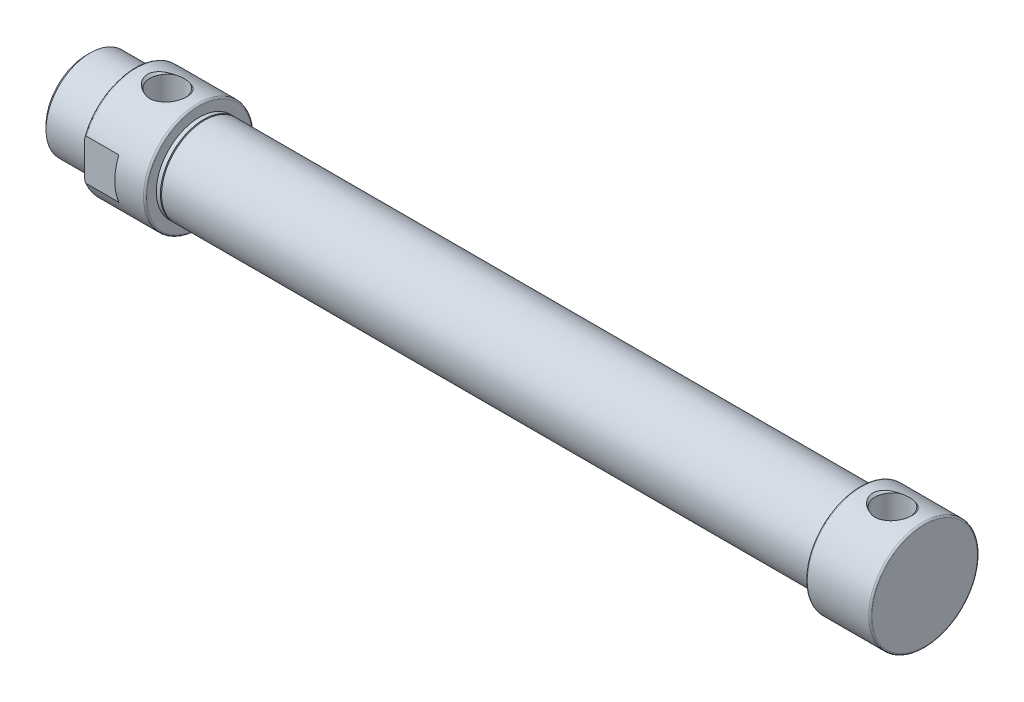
ISO-10303-21;
HEADER;
FILE_DESCRIPTION(('STEP AP214'),'2;1');
FILE_NAME('part.step','',(''),(''),'','','');
FILE_SCHEMA(('AUTOMOTIVE_DESIGN { 1 0 10303 214 1 1 1 1 }'));
ENDSEC;
DATA;
#1=APPLICATION_CONTEXT('core data for automotive mechanical design processes');
#2=APPLICATION_PROTOCOL_DEFINITION('international standard','automotive_design',2000,#1);
#3=PRODUCT_CONTEXT('',#1,'mechanical');
#4=PRODUCT('Part','Part','',(#3));
#5=PRODUCT_RELATED_PRODUCT_CATEGORY('part','',(#4));
#6=PRODUCT_DEFINITION_FORMATION('','',#4);
#7=PRODUCT_DEFINITION_CONTEXT('part definition',#1,'design');
#8=PRODUCT_DEFINITION('design','',#6,#7);
#9=PRODUCT_DEFINITION_SHAPE('','',#8);
#10=(LENGTH_UNIT() NAMED_UNIT(*) SI_UNIT(.MILLI.,.METRE.));
#11=(NAMED_UNIT(*) PLANE_ANGLE_UNIT() SI_UNIT($,.RADIAN.));
#12=(NAMED_UNIT(*) SI_UNIT($,.STERADIAN.) SOLID_ANGLE_UNIT());
#13=UNCERTAINTY_MEASURE_WITH_UNIT(LENGTH_MEASURE(1.E-05),#10,'distance_accuracy_value','');
#14=(GEOMETRIC_REPRESENTATION_CONTEXT(3) GLOBAL_UNCERTAINTY_ASSIGNED_CONTEXT((#13)) GLOBAL_UNIT_ASSIGNED_CONTEXT((#10,
#11,#12)) REPRESENTATION_CONTEXT('',''));
#15=CARTESIAN_POINT('',(0.,0.,0.));
#16=DIRECTION('',(0.,0.,1.));
#17=DIRECTION('',(1.,0.,0.));
#18=AXIS2_PLACEMENT_3D('',#15,#16,#17);
#19=CARTESIAN_POINT('',(208.,0.,0.));
#20=DIRECTION('',(-1.,0.,0.));
#21=DIRECTION('',(0.,0.,1.));
#22=AXIS2_PLACEMENT_3D('',#19,#20,#21);
#23=CYLINDRICAL_SURFACE('',#22,13.5);
#24=CARTESIAN_POINT('',(192.4,0.,0.));
#25=DIRECTION('',(-1.,0.,0.));
#26=DIRECTION('',(0.,0.,1.));
#27=AXIS2_PLACEMENT_3D('',#24,#25,#26);
#28=CIRCLE('',#27,13.5);
#29=CARTESIAN_POINT('',(192.4,0.,13.5));
#30=VERTEX_POINT('',#29);
#31=EDGE_CURVE('E262',#30,#30,#28,.T.);
#32=ORIENTED_EDGE('',*,*,#31,.F.);
#33=EDGE_LOOP('',(#32));
#34=FACE_BOUND('',#33,.T.);
#35=CARTESIAN_POINT('',(207.6,0.,0.));
#36=DIRECTION('',(-1.,0.,0.));
#37=DIRECTION('',(0.,0.,1.));
#38=AXIS2_PLACEMENT_3D('',#35,#36,#37);
#39=CIRCLE('',#38,13.5);
#40=CARTESIAN_POINT('',(207.6,0.,13.5));
#41=VERTEX_POINT('',#40);
#42=EDGE_CURVE('E265',#41,#41,#39,.T.);
#43=ORIENTED_EDGE('',*,*,#42,.T.);
#44=EDGE_LOOP('',(#43));
#45=FACE_BOUND('',#44,.T.);
#46=CARTESIAN_POINT('',(201.730505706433,12.919,-3.91783600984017));
#47=CARTESIAN_POINT('',(201.625388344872,12.9049079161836,-3.96427943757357));
#48=CARTESIAN_POINT('',(201.51827036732,12.8918302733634,-4.00652424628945));
#49=CARTESIAN_POINT('',(201.300731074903,12.8680302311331,-4.08233147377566));
#50=CARTESIAN_POINT('',(201.190309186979,12.8573082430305,-4.11589237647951));
#51=CARTESIAN_POINT('',(200.966965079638,12.8385567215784,-4.17401255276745));
#52=CARTESIAN_POINT('',(200.854044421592,12.8305255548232,-4.19857728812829));
#53=CARTESIAN_POINT('',(200.626431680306,12.8173876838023,-4.23851619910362));
#54=CARTESIAN_POINT('',(200.511739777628,12.8122806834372,-4.25389130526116));
#55=CARTESIAN_POINT('',(200.281180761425,12.8051424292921,-4.27533099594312));
#56=CARTESIAN_POINT('',(200.16531188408,12.8031168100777,-4.2813785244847));
#57=CARTESIAN_POINT('',(199.933453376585,12.8022224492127,-4.28405207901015));
#58=CARTESIAN_POINT('',(199.817463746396,12.803353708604,-4.28067810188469));
#59=CARTESIAN_POINT('',(199.586318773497,12.8087356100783,-4.26454750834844));
#60=CARTESIAN_POINT('',(199.471162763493,12.8129833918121,-4.25179949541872));
#61=CARTESIAN_POINT('',(199.242444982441,12.824458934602,-4.21705821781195));
#62=CARTESIAN_POINT('',(199.128882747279,12.8316858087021,-4.19506770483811));
#63=CARTESIAN_POINT('',(198.888126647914,12.8501297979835,-4.1382611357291));
#64=CARTESIAN_POINT('',(198.761288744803,12.8617679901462,-4.10206663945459));
#65=CARTESIAN_POINT('',(198.511928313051,12.8881638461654,-4.01834041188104));
#66=CARTESIAN_POINT('',(198.389400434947,12.9029174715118,-3.97082334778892));
#67=CARTESIAN_POINT('',(198.269494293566,12.919,-3.91783600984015));
#68=B_SPLINE_CURVE_WITH_KNOTS('',3,(#46,#47,#48,#49,#50,#51,#52,#53,#54,#55,#56,#57,#58,#59,#60,
#61,#62,#63,#64,#65,#66,#67),.UNSPECIFIED.,.F.,.F.,(4,2,2,2,2,2,2,2,2,2,4),(0.,
0.347259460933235,0.694579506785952,1.04168833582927,1.38876201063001,1.73646957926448,
2.08417726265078,2.43156621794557,2.77885182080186,3.17548522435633,3.57160759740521),.UNSPECIFIED.);
#69=CARTESIAN_POINT('',(201.730505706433,12.919,-3.91783600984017));
#70=VERTEX_POINT('',#69);
#71=CARTESIAN_POINT('',(198.269494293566,12.919,-3.91783600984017));
#72=VERTEX_POINT('',#71);
#73=EDGE_CURVE('E11',#70,#72,#68,.T.);
#74=ORIENTED_EDGE('',*,*,#73,.F.);
#75=CARTESIAN_POINT('',(200.997844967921,12.8607,4.10516692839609));
#76=CARTESIAN_POINT('',(201.142526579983,12.8691326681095,4.07869872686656));
#77=CARTESIAN_POINT('',(201.286040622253,12.8793567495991,4.04643594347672));
#78=CARTESIAN_POINT('',(201.56976130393,12.9029929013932,3.97044914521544));
#79=CARTESIAN_POINT('',(201.709967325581,12.9164055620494,3.92672300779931));
#80=CARTESIAN_POINT('',(201.986772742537,12.9460986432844,3.82768709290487));
#81=CARTESIAN_POINT('',(202.123349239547,12.9623938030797,3.77231748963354));
#82=CARTESIAN_POINT('',(202.391028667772,12.9972694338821,3.65034272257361));
#83=CARTESIAN_POINT('',(202.522131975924,13.0158497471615,3.58373833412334));
#84=CARTESIAN_POINT('',(202.904588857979,13.073992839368,3.36793152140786));
#85=CARTESIAN_POINT('',(203.146543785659,13.11612313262,3.20221904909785));
#86=CARTESIAN_POINT('',(203.594874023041,13.2015866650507,2.82921132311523));
#87=CARTESIAN_POINT('',(203.801345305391,13.2449162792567,2.62203162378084));
#88=CARTESIAN_POINT('',(204.123372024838,13.3164616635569,2.22527816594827));
#89=CARTESIAN_POINT('',(204.248799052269,13.3457739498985,2.04390225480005));
#90=CARTESIAN_POINT('',(204.468481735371,13.3986493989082,1.66228444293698));
#91=CARTESIAN_POINT('',(204.562752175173,13.4222152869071,1.46205154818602));
#92=CARTESIAN_POINT('',(204.715481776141,13.4610397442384,1.04605521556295));
#93=CARTESIAN_POINT('',(204.773720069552,13.4762470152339,0.830204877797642));
#94=CARTESIAN_POINT('',(204.849470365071,13.4961212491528,0.391003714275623));
#95=CARTESIAN_POINT('',(204.867007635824,13.5007947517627,0.167657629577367));
#96=CARTESIAN_POINT('',(204.860503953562,13.4990756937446,-0.254447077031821));
#97=CARTESIAN_POINT('',(204.840695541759,13.4938095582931,-0.453288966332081));
#98=CARTESIAN_POINT('',(204.768838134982,13.4749772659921,-0.844608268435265));
#99=CARTESIAN_POINT('',(204.716788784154,13.4614110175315,-1.03708561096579));
#100=CARTESIAN_POINT('',(204.583491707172,13.4274548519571,-1.41013571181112));
#101=CARTESIAN_POINT('',(204.502345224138,13.4070886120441,-1.59074721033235));
#102=CARTESIAN_POINT('',(204.314449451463,13.3614081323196,-1.93736589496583));
#103=CARTESIAN_POINT('',(204.207692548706,13.3360924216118,-2.10336871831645));
#104=CARTESIAN_POINT('',(203.958654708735,13.2794525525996,-2.43679817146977));
#105=CARTESIAN_POINT('',(203.813688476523,13.2477720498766,-2.60215267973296));
#106=CARTESIAN_POINT('',(203.50136590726,13.1835788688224,-2.90998743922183));
#107=CARTESIAN_POINT('',(203.333993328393,13.1510656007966,-3.05245093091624));
#108=CARTESIAN_POINT('',(202.953183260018,13.0827592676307,-3.33401100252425));
#109=CARTESIAN_POINT('',(202.736649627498,13.0472635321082,-3.46899236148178));
#110=CARTESIAN_POINT('',(202.285257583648,12.9821053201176,-3.70540358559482));
#111=CARTESIAN_POINT('',(202.050403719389,12.9524414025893,-3.8068417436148));
#112=CARTESIAN_POINT('',(201.677133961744,12.913213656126,-3.93715694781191));
#113=CARTESIAN_POINT('',(201.54311893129,12.9006255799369,-3.97810586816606));
#114=CARTESIAN_POINT('',(201.272380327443,12.8783911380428,-4.04949012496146));
#115=CARTESIAN_POINT('',(201.13566302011,12.8687386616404,-4.07994731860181));
#116=CARTESIAN_POINT('',(200.997844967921,12.8607,-4.1051669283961));
#117=B_SPLINE_CURVE_WITH_KNOTS('',3,(#75,#76,#77,#78,#79,#80,#81,#82,#83,#84,#85,#86,#87,#88,
#89,#90,#91,#92,#93,#94,#95,#96,#97,#98,#99,#100,#101,#102,#103,#104,#105,#106,#107,#108,#109,
#110,#111,#112,#113,#114,#115,#116),.UNSPECIFIED.,.F.,.F.,(4,2,2,2,2,2,2,2,2,2,2,2,2,2,2,2,2,2,
2,2,4),(0.,0.441837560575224,0.883756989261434,1.3280051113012,1.7722225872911,2.65606246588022,
3.53747285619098,4.20214806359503,4.86650742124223,5.53489979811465,6.20287710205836,
6.79965529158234,7.39644006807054,7.99116817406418,8.58607329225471,9.25004430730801,
9.91449925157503,10.6843053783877,11.4539210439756,11.8756090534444,12.2964131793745),.UNSPECIFIED.);
#118=CARTESIAN_POINT('',(201.730505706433,12.919,3.91783600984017));
#119=VERTEX_POINT('',#118);
#120=EDGE_CURVE('E30',#119,#70,#117,.T.);
#121=ORIENTED_EDGE('',*,*,#120,.F.);
#122=CARTESIAN_POINT('',(198.269494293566,12.919,3.91783600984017));
#123=CARTESIAN_POINT('',(198.374611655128,12.9049079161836,3.96427943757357));
#124=CARTESIAN_POINT('',(198.48172963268,12.8918302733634,4.00652424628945));
#125=CARTESIAN_POINT('',(198.699268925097,12.8680302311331,4.08233147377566));
#126=CARTESIAN_POINT('',(198.809690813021,12.8573082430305,4.11589237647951));
#127=CARTESIAN_POINT('',(199.033034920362,12.8385567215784,4.17401255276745));
#128=CARTESIAN_POINT('',(199.145955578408,12.8305255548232,4.19857728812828));
#129=CARTESIAN_POINT('',(199.373568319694,12.8173876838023,4.23851619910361));
#130=CARTESIAN_POINT('',(199.488260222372,12.8122806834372,4.25389130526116));
#131=CARTESIAN_POINT('',(199.718819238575,12.8051424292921,4.27533099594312));
#132=CARTESIAN_POINT('',(199.83468811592,12.8031168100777,4.2813785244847));
#133=CARTESIAN_POINT('',(200.066546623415,12.8022224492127,4.28405207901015));
#134=CARTESIAN_POINT('',(200.182536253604,12.803353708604,4.28067810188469));
#135=CARTESIAN_POINT('',(200.413681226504,12.8087356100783,4.26454750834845));
#136=CARTESIAN_POINT('',(200.528837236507,12.8129833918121,4.25179949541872));
#137=CARTESIAN_POINT('',(200.75755501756,12.824458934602,4.21705821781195));
#138=CARTESIAN_POINT('',(200.871117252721,12.8316858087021,4.19506770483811));
#139=CARTESIAN_POINT('',(201.111873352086,12.8501297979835,4.13826113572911));
#140=CARTESIAN_POINT('',(201.238711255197,12.8617679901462,4.1020666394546));
#141=CARTESIAN_POINT('',(201.488071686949,12.8881638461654,4.01834041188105));
#142=CARTESIAN_POINT('',(201.610599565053,12.9029174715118,3.97082334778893));
#143=CARTESIAN_POINT('',(201.730505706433,12.919,3.91783600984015));
#144=B_SPLINE_CURVE_WITH_KNOTS('',3,(#122,#123,#124,#125,#126,#127,#128,#129,#130,#131,#132,
#133,#134,#135,#136,#137,#138,#139,#140,#141,#142,#143),.UNSPECIFIED.,.F.,.F.,(4,2,2,2,2,2,2,2,
2,2,4),(0.,0.347259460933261,0.694579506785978,1.04168833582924,1.38876201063,1.73646957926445,
2.08417726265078,2.4315662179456,2.77885182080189,3.1754852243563,3.57160759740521),.UNSPECIFIED.);
#145=CARTESIAN_POINT('',(198.269494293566,12.919,3.91783600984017));
#146=VERTEX_POINT('',#145);
#147=EDGE_CURVE('E99',#146,#119,#144,.T.);
#148=ORIENTED_EDGE('',*,*,#147,.F.);
#149=CARTESIAN_POINT('',(199.002155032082,12.8607,-4.1051669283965));
#150=CARTESIAN_POINT('',(198.85747342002,12.8691326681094,-4.07869872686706));
#151=CARTESIAN_POINT('',(198.713959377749,12.879356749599,-4.04643594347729));
#152=CARTESIAN_POINT('',(198.430238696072,12.902992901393,-3.97044914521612));
#153=CARTESIAN_POINT('',(198.290032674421,12.9164055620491,-3.92672300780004));
#154=CARTESIAN_POINT('',(198.013227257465,12.9460986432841,-3.8276870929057));
#155=CARTESIAN_POINT('',(197.876650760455,12.9623938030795,-3.77231748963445));
#156=CARTESIAN_POINT('',(197.60897133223,12.9972694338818,-3.65034272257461));
#157=CARTESIAN_POINT('',(197.477868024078,13.0158497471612,-3.58373833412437));
#158=CARTESIAN_POINT('',(197.095411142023,13.0739928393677,-3.36793152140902));
#159=CARTESIAN_POINT('',(196.853456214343,13.1161231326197,-3.2022190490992));
#160=CARTESIAN_POINT('',(196.405125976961,13.2015866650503,-2.82921132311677));
#161=CARTESIAN_POINT('',(196.198654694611,13.2449162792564,-2.62203162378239));
#162=CARTESIAN_POINT('',(195.876627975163,13.3164616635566,-2.22527816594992));
#163=CARTESIAN_POINT('',(195.751200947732,13.3457739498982,-2.04390225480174));
#164=CARTESIAN_POINT('',(195.53151826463,13.398649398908,-1.66228444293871));
#165=CARTESIAN_POINT('',(195.437247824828,13.4222152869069,-1.46205154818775));
#166=CARTESIAN_POINT('',(195.284518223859,13.4610397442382,-1.04605521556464));
#167=CARTESIAN_POINT('',(195.226279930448,13.4762470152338,-0.830204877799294));
#168=CARTESIAN_POINT('',(195.150529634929,13.4961212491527,-0.391003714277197));
#169=CARTESIAN_POINT('',(195.132992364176,13.5007947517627,-0.1676576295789));
#170=CARTESIAN_POINT('',(195.139496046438,13.4990756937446,0.254447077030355));
#171=CARTESIAN_POINT('',(195.159304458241,13.4938095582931,0.453288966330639));
#172=CARTESIAN_POINT('',(195.231161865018,13.4749772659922,0.844608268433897));
#173=CARTESIAN_POINT('',(195.283211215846,13.4614110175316,1.03708561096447));
#174=CARTESIAN_POINT('',(195.416508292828,13.4274548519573,1.41013571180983));
#175=CARTESIAN_POINT('',(195.497654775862,13.4070886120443,1.59074721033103));
#176=CARTESIAN_POINT('',(195.685550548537,13.3614081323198,1.93736589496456));
#177=CARTESIAN_POINT('',(195.792307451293,13.336092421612,2.10336871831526));
#178=CARTESIAN_POINT('',(196.041345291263,13.2794525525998,2.43679817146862));
#179=CARTESIAN_POINT('',(196.186311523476,13.2477720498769,2.60215267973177));
#180=CARTESIAN_POINT('',(196.498634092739,13.1835788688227,2.90998743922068));
#181=CARTESIAN_POINT('',(196.666006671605,13.1510656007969,3.05245093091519));
#182=CARTESIAN_POINT('',(197.04681673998,13.0827592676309,3.33401100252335));
#183=CARTESIAN_POINT('',(197.2633503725,13.0472635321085,3.46899236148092));
#184=CARTESIAN_POINT('',(197.714742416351,12.9821053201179,3.70540358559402));
#185=CARTESIAN_POINT('',(197.949596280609,12.9524414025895,3.80684174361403));
#186=CARTESIAN_POINT('',(198.322866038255,12.9132136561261,3.93715694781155));
#187=CARTESIAN_POINT('',(198.45688106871,12.9006255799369,3.97810586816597));
#188=CARTESIAN_POINT('',(198.727619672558,12.8783911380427,4.04949012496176));
#189=CARTESIAN_POINT('',(198.864336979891,12.8687386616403,4.07994731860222));
#190=CARTESIAN_POINT('',(199.002155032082,12.8607,4.1051669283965));
#191=B_SPLINE_CURVE_WITH_KNOTS('',3,(#149,#150,#151,#152,#153,#154,#155,#156,#157,#158,#159,
#160,#161,#162,#163,#164,#165,#166,#167,#168,#169,#170,#171,#172,#173,#174,#175,#176,#177,#178,
#179,#180,#181,#182,#183,#184,#185,#186,#187,#188,#189,#190),.UNSPECIFIED.,.F.,.F.,(4,2,2,2,2,2,
2,2,2,2,2,2,2,2,2,2,2,2,2,2,4),(0.,0.441837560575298,0.883756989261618,1.32800511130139,
1.77222258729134,2.65606246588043,3.53747285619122,4.20214806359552,4.86650742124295,
5.53489979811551,6.20287710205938,6.7996552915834,7.39644006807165,7.99116817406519,
8.58607329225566,9.25004430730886,9.91449925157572,10.6843053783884,11.4539210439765,
11.8756090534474,12.2964131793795),.UNSPECIFIED.);
#192=EDGE_CURVE('E106',#72,#146,#191,.T.);
#193=ORIENTED_EDGE('',*,*,#192,.F.);
#194=EDGE_LOOP('',(#74,#121,#148,#193));
#195=FACE_BOUND('',#194,.T.);
#196=ADVANCED_FACE('F16',(#34,#45,#195),#23,.T.);
#197=CARTESIAN_POINT('',(208.,0.,0.));
#198=DIRECTION('',(-1.,0.,0.));
#199=DIRECTION('',(0.,0.,1.));
#200=AXIS2_PLACEMENT_3D('',#197,#198,#199);
#201=CYLINDRICAL_SURFACE('',#200,13.5);
#202=DIRECTION('',(-1.,0.,0.));
#203=VECTOR('',#202,1.);
#204=CARTESIAN_POINT('',(208.,-5.09901951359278,12.5));
#205=LINE('',#204,#203);
#206=CARTESIAN_POINT('',(20.5,-5.09901951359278,12.5));
#207=VERTEX_POINT('',#206);
#208=CARTESIAN_POINT('',(12.4,-5.09901951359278,12.5));
#209=VERTEX_POINT('',#208);
#210=EDGE_CURVE('E193',#207,#209,#205,.T.);
#211=ORIENTED_EDGE('',*,*,#210,.T.);
#212=CARTESIAN_POINT('',(12.4,0.,0.));
#213=DIRECTION('',(-1.,0.,0.));
#214=DIRECTION('',(0.,0.,1.));
#215=AXIS2_PLACEMENT_3D('',#212,#213,#214);
#216=CIRCLE('',#215,13.5);
#217=CARTESIAN_POINT('',(12.4,-5.09901951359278,-12.5));
#218=VERTEX_POINT('',#217);
#219=EDGE_CURVE('E228',#218,#209,#216,.T.);
#220=ORIENTED_EDGE('',*,*,#219,.F.);
#221=DIRECTION('',(-1.,0.,0.));
#222=VECTOR('',#221,1.);
#223=CARTESIAN_POINT('',(208.,-5.09901951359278,-12.5));
#224=LINE('',#223,#222);
#225=CARTESIAN_POINT('',(20.5,-5.09901951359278,-12.5));
#226=VERTEX_POINT('',#225);
#227=EDGE_CURVE('E210',#218,#226,#224,.F.);
#228=ORIENTED_EDGE('',*,*,#227,.T.);
#229=CARTESIAN_POINT('',(20.5,0.,0.));
#230=DIRECTION('',(1.,0.,0.));
#231=DIRECTION('',(0.,0.,-1.));
#232=AXIS2_PLACEMENT_3D('',#229,#230,#231);
#233=CIRCLE('',#232,13.5);
#234=CARTESIAN_POINT('',(20.5,5.09901951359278,-12.5));
#235=VERTEX_POINT('',#234);
#236=EDGE_CURVE('E202',#226,#235,#233,.T.);
#237=ORIENTED_EDGE('',*,*,#236,.T.);
#238=DIRECTION('',(-1.,0.,0.));
#239=VECTOR('',#238,1.);
#240=CARTESIAN_POINT('',(208.,5.09901951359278,-12.5));
#241=LINE('',#240,#239);
#242=CARTESIAN_POINT('',(12.4,5.09901951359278,-12.5));
#243=VERTEX_POINT('',#242);
#244=EDGE_CURVE('E206',#235,#243,#241,.T.);
#245=ORIENTED_EDGE('',*,*,#244,.T.);
#246=CARTESIAN_POINT('',(12.4,5.09901951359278,12.5));
#247=VERTEX_POINT('',#246);
#248=EDGE_CURVE('E226',#247,#243,#216,.T.);
#249=ORIENTED_EDGE('',*,*,#248,.F.);
#250=DIRECTION('',(-1.,0.,0.));
#251=VECTOR('',#250,1.);
#252=CARTESIAN_POINT('',(208.,5.09901951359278,12.5));
#253=LINE('',#252,#251);
#254=CARTESIAN_POINT('',(20.5,5.09901951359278,12.5));
#255=VERTEX_POINT('',#254);
#256=EDGE_CURVE('E200',#247,#255,#253,.F.);
#257=ORIENTED_EDGE('',*,*,#256,.T.);
#258=EDGE_CURVE('E197',#255,#207,#233,.T.);
#259=ORIENTED_EDGE('',*,*,#258,.T.);
#260=EDGE_LOOP('',(#211,#220,#228,#237,#245,#249,#257,#259));
#261=FACE_BOUND('',#260,.T.);
#262=CARTESIAN_POINT('',(27.6,0.,0.));
#263=DIRECTION('',(-1.,0.,0.));
#264=DIRECTION('',(0.,0.,1.));
#265=AXIS2_PLACEMENT_3D('',#262,#263,#264);
#266=CIRCLE('',#265,13.5);
#267=CARTESIAN_POINT('',(27.6,0.,13.5));
#268=VERTEX_POINT('',#267);
#269=EDGE_CURVE('E229',#268,#268,#266,.T.);
#270=ORIENTED_EDGE('',*,*,#269,.T.);
#271=EDGE_LOOP('',(#270));
#272=FACE_BOUND('',#271,.T.);
#273=CARTESIAN_POINT('',(21.7305057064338,12.919,-3.91783600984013));
#274=CARTESIAN_POINT('',(21.6253883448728,12.9049079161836,-3.96427943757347));
#275=CARTESIAN_POINT('',(21.5182703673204,12.8918302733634,-4.00652424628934));
#276=CARTESIAN_POINT('',(21.3007310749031,12.8680302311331,-4.08233147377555));
#277=CARTESIAN_POINT('',(21.1903091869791,12.8573082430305,-4.11589237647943));
#278=CARTESIAN_POINT('',(20.9669650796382,12.8385567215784,-4.17401255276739));
#279=CARTESIAN_POINT('',(20.8540444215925,12.8305255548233,-4.19857728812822));
#280=CARTESIAN_POINT('',(20.6264316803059,12.8173876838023,-4.23851619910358));
#281=CARTESIAN_POINT('',(20.5117397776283,12.8122806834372,-4.25389130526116));
#282=CARTESIAN_POINT('',(20.2811807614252,12.8051424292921,-4.27533099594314));
#283=CARTESIAN_POINT('',(20.1653118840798,12.8031168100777,-4.2813785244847));
#284=CARTESIAN_POINT('',(19.9334533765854,12.8022224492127,-4.28405207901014));
#285=CARTESIAN_POINT('',(19.8174637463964,12.803353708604,-4.2806781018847));
#286=CARTESIAN_POINT('',(19.5863187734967,12.8087356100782,-4.26454750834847));
#287=CARTESIAN_POINT('',(19.4711627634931,12.8129833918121,-4.25179949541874));
#288=CARTESIAN_POINT('',(19.2424449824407,12.824458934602,-4.21705821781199));
#289=CARTESIAN_POINT('',(19.1288827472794,12.8316858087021,-4.19506770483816));
#290=CARTESIAN_POINT('',(18.8881266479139,12.8501297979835,-4.13826113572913));
#291=CARTESIAN_POINT('',(18.7612887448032,12.8617679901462,-4.10206663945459));
#292=CARTESIAN_POINT('',(18.5119283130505,12.8881638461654,-4.01834041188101));
#293=CARTESIAN_POINT('',(18.389400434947,12.9029174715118,-3.97082334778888));
#294=CARTESIAN_POINT('',(18.2694942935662,12.919,-3.91783600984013));
#295=B_SPLINE_CURVE_WITH_KNOTS('',3,(#273,#274,#275,#276,#277,#278,#279,#280,#281,#282,#283,
#284,#285,#286,#287,#288,#289,#290,#291,#292,#293,#294),.UNSPECIFIED.,.F.,.F.,(4,2,2,2,2,2,2,2,
2,2,4),(0.,0.347259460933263,0.69457950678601,1.04168833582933,1.38876201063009,
1.73646957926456,2.08417726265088,2.43156621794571,2.77885182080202,3.17548522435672,
3.57160759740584),.UNSPECIFIED.);
#296=CARTESIAN_POINT('',(21.7305057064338,12.919,-3.91783600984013));
#297=VERTEX_POINT('',#296);
#298=CARTESIAN_POINT('',(18.2694942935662,12.919,-3.91783600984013));
#299=VERTEX_POINT('',#298);
#300=EDGE_CURVE('E107',#297,#299,#295,.T.);
#301=ORIENTED_EDGE('',*,*,#300,.F.);
#302=CARTESIAN_POINT('',(20.9978449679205,12.8607000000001,4.10516692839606));
#303=CARTESIAN_POINT('',(21.1425265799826,12.8691326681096,4.07869872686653));
#304=CARTESIAN_POINT('',(21.2860406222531,12.8793567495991,4.04643594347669));
#305=CARTESIAN_POINT('',(21.5697613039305,12.9029929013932,3.9704491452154));
#306=CARTESIAN_POINT('',(21.7099673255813,12.9164055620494,3.92672300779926));
#307=CARTESIAN_POINT('',(21.986772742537,12.9460986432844,3.82768709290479));
#308=CARTESIAN_POINT('',(22.1233492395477,12.9623938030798,3.77231748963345));
#309=CARTESIAN_POINT('',(22.391028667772,12.9972694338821,3.6503427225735));
#310=CARTESIAN_POINT('',(22.5221319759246,13.0158497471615,3.58373833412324));
#311=CARTESIAN_POINT('',(22.9045888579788,13.0739928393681,3.36793152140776));
#312=CARTESIAN_POINT('',(23.1465437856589,13.11612313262,3.20221904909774));
#313=CARTESIAN_POINT('',(23.5948740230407,13.2015866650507,2.82921132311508));
#314=CARTESIAN_POINT('',(23.801345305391,13.2449162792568,2.62203162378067));
#315=CARTESIAN_POINT('',(24.1233720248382,13.3164616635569,2.22527816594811));
#316=CARTESIAN_POINT('',(24.2487990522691,13.3457739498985,2.0439022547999));
#317=CARTESIAN_POINT('',(24.4684817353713,13.3986493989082,1.66228444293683));
#318=CARTESIAN_POINT('',(24.5627521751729,13.4222152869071,1.46205154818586));
#319=CARTESIAN_POINT('',(24.7154817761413,13.4610397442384,1.04605521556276));
#320=CARTESIAN_POINT('',(24.7737200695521,13.4762470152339,0.830204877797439));
#321=CARTESIAN_POINT('',(24.8494703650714,13.4961212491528,0.391003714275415));
#322=CARTESIAN_POINT('',(24.8670076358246,13.5007947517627,0.167657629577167));
#323=CARTESIAN_POINT('',(24.8605039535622,13.4990756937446,-0.254447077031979));
#324=CARTESIAN_POINT('',(24.8406955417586,13.4938095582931,-0.453288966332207));
#325=CARTESIAN_POINT('',(24.7688381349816,13.4749772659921,-0.8446082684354));
#326=CARTESIAN_POINT('',(24.7167887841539,13.4614110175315,-1.03708561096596));
#327=CARTESIAN_POINT('',(24.583491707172,13.4274548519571,-1.41013571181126));
#328=CARTESIAN_POINT('',(24.5023452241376,13.4070886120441,-1.59074721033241));
#329=CARTESIAN_POINT('',(24.3144494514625,13.3614081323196,-1.93736589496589));
#330=CARTESIAN_POINT('',(24.2076925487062,13.3360924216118,-2.10336871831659));
#331=CARTESIAN_POINT('',(23.9586547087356,13.2794525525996,-2.43679817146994));
#332=CARTESIAN_POINT('',(23.813688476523,13.2477720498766,-2.60215267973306));
#333=CARTESIAN_POINT('',(23.5013659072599,13.1835788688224,-2.90998743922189));
#334=CARTESIAN_POINT('',(23.3339933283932,13.1510656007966,-3.05245093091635));
#335=CARTESIAN_POINT('',(22.9531832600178,13.0827592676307,-3.33401100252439));
#336=CARTESIAN_POINT('',(22.7366496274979,13.0472635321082,-3.46899236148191));
#337=CARTESIAN_POINT('',(22.2852575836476,12.9821053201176,-3.70540358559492));
#338=CARTESIAN_POINT('',(22.0504037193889,12.9524414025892,-3.80684174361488));
#339=CARTESIAN_POINT('',(21.6771339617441,12.913213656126,-3.93715694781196));
#340=CARTESIAN_POINT('',(21.5431189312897,12.9006255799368,-3.97810586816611));
#341=CARTESIAN_POINT('',(21.2723803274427,12.8783911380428,-4.04949012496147));
#342=CARTESIAN_POINT('',(21.1356630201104,12.8687386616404,-4.0799473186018));
#343=CARTESIAN_POINT('',(20.9978449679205,12.8607000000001,-4.10516692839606));
#344=B_SPLINE_CURVE_WITH_KNOTS('',3,(#302,#303,#304,#305,#306,#307,#308,#309,#310,#311,#312,
#313,#314,#315,#316,#317,#318,#319,#320,#321,#322,#323,#324,#325,#326,#327,#328,#329,#330,#331,
#332,#333,#334,#335,#336,#337,#338,#339,#340,#341,#342,#343),.UNSPECIFIED.,.F.,.F.,(4,2,2,2,2,2,
2,2,2,2,2,2,2,2,2,2,2,2,2,2,4),(0.,0.441837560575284,0.883756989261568,1.32800511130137,
1.77222258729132,2.65606246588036,3.53747285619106,4.20214806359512,4.86650742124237,
5.53489979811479,6.20287710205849,6.79965529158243,7.39644006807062,7.99116817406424,
8.58607329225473,9.25004430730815,9.91449925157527,10.6843053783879,11.4539210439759,
11.8756090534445,12.2964131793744),.UNSPECIFIED.);
#345=CARTESIAN_POINT('',(21.7305057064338,12.919,3.91783600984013));
#346=VERTEX_POINT('',#345);
#347=EDGE_CURVE('E162',#346,#297,#344,.T.);
#348=ORIENTED_EDGE('',*,*,#347,.F.);
#349=CARTESIAN_POINT('',(18.2694942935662,12.919,3.91783600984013));
#350=CARTESIAN_POINT('',(18.3746116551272,12.9049079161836,3.96427943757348));
#351=CARTESIAN_POINT('',(18.4817296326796,12.8918302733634,4.00652424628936));
#352=CARTESIAN_POINT('',(18.6992689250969,12.8680302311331,4.08233147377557));
#353=CARTESIAN_POINT('',(18.809690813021,12.8573082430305,4.11589237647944));
#354=CARTESIAN_POINT('',(19.0330349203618,12.8385567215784,4.17401255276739));
#355=CARTESIAN_POINT('',(19.1459555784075,12.8305255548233,4.19857728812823));
#356=CARTESIAN_POINT('',(19.3735683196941,12.8173876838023,4.23851619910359));
#357=CARTESIAN_POINT('',(19.4882602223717,12.8122806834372,4.25389130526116));
#358=CARTESIAN_POINT('',(19.7188192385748,12.8051424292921,4.27533099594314));
#359=CARTESIAN_POINT('',(19.8346881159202,12.8031168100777,4.2813785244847));
#360=CARTESIAN_POINT('',(20.0665466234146,12.8022224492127,4.28405207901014));
#361=CARTESIAN_POINT('',(20.1825362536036,12.803353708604,4.2806781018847));
#362=CARTESIAN_POINT('',(20.4136812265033,12.8087356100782,4.26454750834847));
#363=CARTESIAN_POINT('',(20.5288372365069,12.8129833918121,4.25179949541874));
#364=CARTESIAN_POINT('',(20.7575550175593,12.824458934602,4.21705821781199));
#365=CARTESIAN_POINT('',(20.8711172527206,12.8316858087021,4.19506770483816));
#366=CARTESIAN_POINT('',(21.1118733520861,12.8501297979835,4.13826113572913));
#367=CARTESIAN_POINT('',(21.2387112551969,12.8617679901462,4.10206663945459));
#368=CARTESIAN_POINT('',(21.4880716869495,12.8881638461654,4.018340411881));
#369=CARTESIAN_POINT('',(21.610599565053,12.9029174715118,3.97082334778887));
#370=CARTESIAN_POINT('',(21.7305057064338,12.919,3.91783600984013));
#371=B_SPLINE_CURVE_WITH_KNOTS('',3,(#349,#350,#351,#352,#353,#354,#355,#356,#357,#358,#359,
#360,#361,#362,#363,#364,#365,#366,#367,#368,#369,#370),.UNSPECIFIED.,.F.,.F.,(4,2,2,2,2,2,2,2,
2,2,4),(0.,0.347259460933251,0.69457950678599,1.0416883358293,1.38876201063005,1.73646957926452,
2.08417726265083,2.43156621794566,2.77885182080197,3.1754852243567,3.57160759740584),.UNSPECIFIED.);
#372=CARTESIAN_POINT('',(18.2694942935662,12.919,3.91783600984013));
#373=VERTEX_POINT('',#372);
#374=EDGE_CURVE('E148',#373,#346,#371,.T.);
#375=ORIENTED_EDGE('',*,*,#374,.F.);
#376=CARTESIAN_POINT('',(19.0021550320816,12.8607,-4.10516692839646));
#377=CARTESIAN_POINT('',(18.8574734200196,12.8691326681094,-4.07869872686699));
#378=CARTESIAN_POINT('',(18.7139593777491,12.879356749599,-4.04643594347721));
#379=CARTESIAN_POINT('',(18.4302386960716,12.902992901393,-3.97044914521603));
#380=CARTESIAN_POINT('',(18.2900326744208,12.9164055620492,-3.92672300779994));
#381=CARTESIAN_POINT('',(18.0132272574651,12.9460986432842,-3.82768709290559));
#382=CARTESIAN_POINT('',(17.8766507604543,12.9623938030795,-3.7723174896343));
#383=CARTESIAN_POINT('',(17.60897133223,12.9972694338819,-3.65034272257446));
#384=CARTESIAN_POINT('',(17.4778680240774,13.0158497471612,-3.58373833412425));
#385=CARTESIAN_POINT('',(17.0954111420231,13.0739928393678,-3.36793152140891));
#386=CARTESIAN_POINT('',(16.8534562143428,13.1161231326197,-3.20221904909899));
#387=CARTESIAN_POINT('',(16.4051259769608,13.2015866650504,-2.82921132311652));
#388=CARTESIAN_POINT('',(16.1986546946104,13.2449162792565,-2.6220316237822));
#389=CARTESIAN_POINT('',(15.876627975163,13.3164616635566,-2.22527816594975));
#390=CARTESIAN_POINT('',(15.751200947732,13.3457739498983,-2.04390225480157));
#391=CARTESIAN_POINT('',(15.5315182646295,13.398649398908,-1.66228444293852));
#392=CARTESIAN_POINT('',(15.4372478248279,13.4222152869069,-1.46205154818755));
#393=CARTESIAN_POINT('',(15.2845182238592,13.4610397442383,-1.04605521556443));
#394=CARTESIAN_POINT('',(15.2262799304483,13.4762470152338,-0.830204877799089));
#395=CARTESIAN_POINT('',(15.1505296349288,13.4961212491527,-0.391003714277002));
#396=CARTESIAN_POINT('',(15.1329923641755,13.5007947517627,-0.16765762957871));
#397=CARTESIAN_POINT('',(15.1394960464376,13.4990756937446,0.254447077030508));
#398=CARTESIAN_POINT('',(15.1593044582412,13.4938095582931,0.453288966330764));
#399=CARTESIAN_POINT('',(15.2311618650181,13.4749772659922,0.844608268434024));
#400=CARTESIAN_POINT('',(15.2832112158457,13.4614110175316,1.03708561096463));
#401=CARTESIAN_POINT('',(15.4165082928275,13.4274548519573,1.41013571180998));
#402=CARTESIAN_POINT('',(15.4976547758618,13.4070886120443,1.59074721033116));
#403=CARTESIAN_POINT('',(15.6855505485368,13.3614081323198,1.93736589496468));
#404=CARTESIAN_POINT('',(15.792307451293,13.336092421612,2.1033687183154));
#405=CARTESIAN_POINT('',(16.0413452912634,13.2794525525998,2.43679817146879));
#406=CARTESIAN_POINT('',(16.1863115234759,13.2477720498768,2.60215267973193));
#407=CARTESIAN_POINT('',(16.4986340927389,13.1835788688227,2.90998743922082));
#408=CARTESIAN_POINT('',(16.6660066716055,13.1510656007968,3.05245093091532));
#409=CARTESIAN_POINT('',(17.0468167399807,13.0827592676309,3.33401100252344));
#410=CARTESIAN_POINT('',(17.2633503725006,13.0472635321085,3.46899236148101));
#411=CARTESIAN_POINT('',(17.7147424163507,12.9821053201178,3.70540358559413));
#412=CARTESIAN_POINT('',(17.9495962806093,12.9524414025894,3.80684174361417));
#413=CARTESIAN_POINT('',(18.3228660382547,12.9132136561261,3.9371569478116));
#414=CARTESIAN_POINT('',(18.4568810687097,12.9006255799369,3.97810586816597));
#415=CARTESIAN_POINT('',(18.7276196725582,12.8783911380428,4.04949012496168));
#416=CARTESIAN_POINT('',(18.8643369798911,12.8687386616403,4.07994731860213));
#417=CARTESIAN_POINT('',(19.0021550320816,12.8607,4.10516692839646));
#418=B_SPLINE_CURVE_WITH_KNOTS('',3,(#376,#377,#378,#379,#380,#381,#382,#383,#384,#385,#386,
#387,#388,#389,#390,#391,#392,#393,#394,#395,#396,#397,#398,#399,#400,#401,#402,#403,#404,#405,
#406,#407,#408,#409,#410,#411,#412,#413,#414,#415,#416,#417),.UNSPECIFIED.,.F.,.F.,(4,2,2,2,2,2,
2,2,2,2,2,2,2,2,2,2,2,2,2,2,4),(0.,0.4418375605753,0.883756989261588,1.32800511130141,
1.77222258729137,2.65606246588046,3.53747285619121,4.2021480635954,4.86650742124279,
5.53489979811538,6.20287710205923,6.79965529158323,7.39644006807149,7.99116817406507,
8.58607329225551,9.2500443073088,9.9144992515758,10.6843053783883,11.4539210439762,
11.8756090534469,12.2964131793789),.UNSPECIFIED.);
#419=EDGE_CURVE('E186',#299,#373,#418,.T.);
#420=ORIENTED_EDGE('',*,*,#419,.F.);
#421=EDGE_LOOP('',(#301,#348,#375,#420));
#422=FACE_BOUND('',#421,.T.);
#423=ADVANCED_FACE('F171',(#261,#272,#422),#201,.T.);
#424=CARTESIAN_POINT('',(12.4,0.,0.));
#425=DIRECTION('',(-1.,0.,0.));
#426=DIRECTION('',(0.,0.,1.));
#427=AXIS2_PLACEMENT_3D('',#424,#425,#426);
#428=TOROIDAL_SURFACE('',#427,13.1,0.4);
#429=ORIENTED_EDGE('',*,*,#219,.T.);
#430=CARTESIAN_POINT('',(12.4788950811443,-5.07817912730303,12.5));
#431=CARTESIAN_POINT('',(12.4707430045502,-5.0825363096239,12.5));
#432=CARTESIAN_POINT('',(12.4622935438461,-5.08634466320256,12.5));
#433=CARTESIAN_POINT('',(12.4448968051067,-5.09258043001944,12.5));
#434=CARTESIAN_POINT('',(12.4359500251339,-5.09500919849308,12.5));
#435=CARTESIAN_POINT('',(12.4176963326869,-5.09826131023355,12.5));
#436=CARTESIAN_POINT('',(12.4083873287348,-5.09907323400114,12.5));
#437=CARTESIAN_POINT('',(12.3897800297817,-5.09896023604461,12.5));
#438=CARTESIAN_POINT('',(12.3804817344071,-5.09803537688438,12.5));
#439=CARTESIAN_POINT('',(12.3629133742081,-5.09469464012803,12.5));
#440=CARTESIAN_POINT('',(12.3546194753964,-5.092399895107,12.5));
#441=CARTESIAN_POINT('',(12.3384609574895,-5.08662216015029,12.5));
#442=CARTESIAN_POINT('',(12.3305965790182,-5.08313851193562,12.5));
#443=CARTESIAN_POINT('',(12.3108605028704,-5.07285262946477,12.5));
#444=CARTESIAN_POINT('',(12.2993776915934,-5.06530745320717,12.5));
#445=CARTESIAN_POINT('',(12.2777058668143,-5.04854568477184,12.5));
#446=CARTESIAN_POINT('',(12.2675209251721,-5.03932404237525,12.5));
#447=CARTESIAN_POINT('',(12.2404772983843,-5.01180473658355,12.5));
#448=CARTESIAN_POINT('',(12.2249341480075,-4.99222909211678,12.5));
#449=CARTESIAN_POINT('',(12.1966723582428,-4.95116761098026,12.5));
#450=CARTESIAN_POINT('',(12.1839617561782,-4.92967657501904,12.5));
#451=CARTESIAN_POINT('',(12.1557933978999,-4.87632687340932,12.5));
#452=CARTESIAN_POINT('',(12.14142059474,-4.84390153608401,12.5));
#453=CARTESIAN_POINT('',(12.1157400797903,-4.77783793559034,12.5));
#454=CARTESIAN_POINT('',(12.1044387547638,-4.74419730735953,12.5));
#455=CARTESIAN_POINT('',(12.0841616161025,-4.67606088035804,12.5));
#456=CARTESIAN_POINT('',(12.0751968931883,-4.6415618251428,12.5));
#457=CARTESIAN_POINT('',(12.0591975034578,-4.57216290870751,12.5));
#458=CARTESIAN_POINT('',(12.0521610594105,-4.537263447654,12.5));
#459=CARTESIAN_POINT('',(12.0366793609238,-4.45034777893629,12.5));
#460=CARTESIAN_POINT('',(12.0291813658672,-4.39816339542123,12.5));
#461=CARTESIAN_POINT('',(12.0169726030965,-4.29346301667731,12.5));
#462=CARTESIAN_POINT('',(12.0122630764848,-4.24094688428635,12.5));
#463=CARTESIAN_POINT('',(12.0015994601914,-4.08298800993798,12.5));
#464=CARTESIAN_POINT('',(11.9991371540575,-3.97730598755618,12.5));
#465=CARTESIAN_POINT('',(12.0013640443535,-3.76589624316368,12.5));
#466=CARTESIAN_POINT('',(12.0060655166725,-3.66016875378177,12.5));
#467=CARTESIAN_POINT('',(12.0216538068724,-3.44928486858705,12.5));
#468=CARTESIAN_POINT('',(12.0325336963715,-3.34412796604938,12.5));
#469=CARTESIAN_POINT('',(12.0539305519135,-3.18299813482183,12.5));
#470=CARTESIAN_POINT('',(12.0622962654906,-3.12673086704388,12.5));
#471=CARTESIAN_POINT('',(12.0809147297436,-3.01448153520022,12.5));
#472=CARTESIAN_POINT('',(12.0911682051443,-2.95849958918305,12.5));
#473=CARTESIAN_POINT('',(12.1137862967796,-2.84725780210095,12.5));
#474=CARTESIAN_POINT('',(12.1261399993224,-2.79199574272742,12.5));
#475=CARTESIAN_POINT('',(12.1535585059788,-2.68215847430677,12.5));
#476=CARTESIAN_POINT('',(12.1686213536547,-2.62758279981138,12.5));
#477=CARTESIAN_POINT('',(12.193449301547,-2.54955482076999,12.5));
#478=CARTESIAN_POINT('',(12.2015417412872,-2.52557063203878,12.5));
#479=CARTESIAN_POINT('',(12.2188883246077,-2.47790479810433,12.5));
#480=CARTESIAN_POINT('',(12.2281468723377,-2.45422469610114,12.5));
#481=CARTESIAN_POINT('',(12.2483682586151,-2.40738583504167,12.5));
#482=CARTESIAN_POINT('',(12.2593445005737,-2.38423297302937,12.5));
#483=CARTESIAN_POINT('',(12.2838746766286,-2.33934269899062,12.5));
#484=CARTESIAN_POINT('',(12.2974102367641,-2.31759659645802,12.5));
#485=CARTESIAN_POINT('',(12.31799869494,-2.29243475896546,12.5));
#486=CARTESIAN_POINT('',(12.3226747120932,-2.2871218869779,12.5));
#487=CARTESIAN_POINT('',(12.3325544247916,-2.27699347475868,12.5));
#488=CARTESIAN_POINT('',(12.3377583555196,-2.2721781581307,12.5));
#489=CARTESIAN_POINT('',(12.3478454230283,-2.26408456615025,12.5));
#490=CARTESIAN_POINT('',(12.3526291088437,-2.26068443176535,12.5));
#491=CARTESIAN_POINT('',(12.3626708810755,-2.25467153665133,12.5));
#492=CARTESIAN_POINT('',(12.3679277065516,-2.25205675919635,12.5));
#493=CARTESIAN_POINT('',(12.3773203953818,-2.24852297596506,12.5));
#494=CARTESIAN_POINT('',(12.3813531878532,-2.24733356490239,12.5));
#495=CARTESIAN_POINT('',(12.3895603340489,-2.24564655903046,12.5));
#496=CARTESIAN_POINT('',(12.3937344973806,-2.24514806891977,12.5));
#497=CARTESIAN_POINT('',(12.4021174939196,-2.24490162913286,12.5));
#498=CARTESIAN_POINT('',(12.4063263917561,-2.2451558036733,12.5));
#499=CARTESIAN_POINT('',(12.4146376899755,-2.24638695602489,12.5));
#500=CARTESIAN_POINT('',(12.4187399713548,-2.24736470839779,12.5));
#501=CARTESIAN_POINT('',(12.4279131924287,-2.25031482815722,12.5));
#502=CARTESIAN_POINT('',(12.4329164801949,-2.25249447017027,12.5));
#503=CARTESIAN_POINT('',(12.4425155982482,-2.25761345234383,12.5));
#504=CARTESIAN_POINT('',(12.4471104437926,-2.26055456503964,12.5));
#505=CARTESIAN_POINT('',(12.4593422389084,-2.26946370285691,12.5));
#506=CARTESIAN_POINT('',(12.4665563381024,-2.27600327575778,12.5));
#507=CARTESIAN_POINT('',(12.4800340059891,-2.28998794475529,12.5));
#508=CARTESIAN_POINT('',(12.4862943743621,-2.2974359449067,12.5));
#509=CARTESIAN_POINT('',(12.501868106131,-2.31776992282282,12.5));
#510=CARTESIAN_POINT('',(12.5105914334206,-2.33110222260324,12.5));
#511=CARTESIAN_POINT('',(12.5268324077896,-2.35849224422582,12.5));
#512=CARTESIAN_POINT('',(12.534346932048,-2.3725517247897,12.5));
#513=CARTESIAN_POINT('',(12.5485513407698,-2.40117843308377,12.5));
#514=CARTESIAN_POINT('',(12.5552362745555,-2.41574810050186,12.5));
#515=CARTESIAN_POINT('',(12.5679400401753,-2.44514814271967,12.5));
#516=CARTESIAN_POINT('',(12.5739597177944,-2.45997815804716,12.5));
#517=CARTESIAN_POINT('',(12.59304203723,-2.50936916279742,12.5));
#518=CARTESIAN_POINT('',(12.6050112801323,-2.54435135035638,12.5));
#519=CARTESIAN_POINT('',(12.6271966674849,-2.61487265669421,12.5));
#520=CARTESIAN_POINT('',(12.637411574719,-2.65041214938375,12.5));
#521=CARTESIAN_POINT('',(12.6661499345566,-2.75770725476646,12.5));
#522=CARTESIAN_POINT('',(12.6827141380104,-2.82998726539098,12.5));
#523=CARTESIAN_POINT('',(12.7122171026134,-2.97520814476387,12.5));
#524=CARTESIAN_POINT('',(12.7251579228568,-3.04814861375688,12.5));
#525=CARTESIAN_POINT('',(12.7479233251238,-3.1944224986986,12.5));
#526=CARTESIAN_POINT('',(12.7577517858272,-3.26775530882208,12.5));
#527=CARTESIAN_POINT('',(12.7717963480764,-3.39134067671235,12.5));
#528=CARTESIAN_POINT('',(12.7768029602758,-3.4415050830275,12.5));
#529=CARTESIAN_POINT('',(12.7854166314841,-3.54196173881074,12.5));
#530=CARTESIAN_POINT('',(12.7890234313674,-3.5922540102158,12.5));
#531=CARTESIAN_POINT('',(12.7976504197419,-3.74304883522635,12.5));
#532=CARTESIAN_POINT('',(12.8005028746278,-3.84369203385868,12.5));
#533=CARTESIAN_POINT('',(12.7995215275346,-4.01573640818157,12.5));
#534=CARTESIAN_POINT('',(12.7973879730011,-4.08714716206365,12.5));
#535=CARTESIAN_POINT('',(12.7889700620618,-4.22971220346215,12.5));
#536=CARTESIAN_POINT('',(12.7826870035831,-4.30086656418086,12.5));
#537=CARTESIAN_POINT('',(12.7646896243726,-4.4440834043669,12.5));
#538=CARTESIAN_POINT('',(12.7528631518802,-4.51613322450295,12.5));
#539=CARTESIAN_POINT('',(12.7293875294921,-4.62284706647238,12.5));
#540=CARTESIAN_POINT('',(12.72062237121,-4.65814374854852,12.5));
#541=CARTESIAN_POINT('',(12.700686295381,-4.72809471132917,12.5));
#542=CARTESIAN_POINT('',(12.6895141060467,-4.76274864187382,12.5));
#543=CARTESIAN_POINT('',(12.6669870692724,-4.82300329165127,12.5));
#544=CARTESIAN_POINT('',(12.6562738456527,-4.84884186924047,12.5));
#545=CARTESIAN_POINT('',(12.6324844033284,-4.89938659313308,12.5));
#546=CARTESIAN_POINT('',(12.6194130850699,-4.92409495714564,12.5));
#547=CARTESIAN_POINT('',(12.5944252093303,-4.96454334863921,12.5));
#548=CARTESIAN_POINT('',(12.5833108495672,-4.98077422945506,12.5));
#549=CARTESIAN_POINT('',(12.5590891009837,-5.01168132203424,12.5));
#550=CARTESIAN_POINT('',(12.5459868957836,-5.02636141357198,12.5));
#551=CARTESIAN_POINT('',(12.5236638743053,-5.04716297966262,12.5));
#552=CARTESIAN_POINT('',(12.5152961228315,-5.05419426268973,12.5));
#553=CARTESIAN_POINT('',(12.4977215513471,-5.06713093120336,12.5));
#554=CARTESIAN_POINT('',(12.4885153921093,-5.07303719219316,12.5));
#555=CARTESIAN_POINT('',(12.4788950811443,-5.07817912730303,12.5));
#556=B_SPLINE_CURVE_WITH_KNOTS('',3,(#430,#431,#432,#433,#434,#435,#436,#437,#438,#439,#440,
#441,#442,#443,#444,#445,#446,#447,#448,#449,#450,#451,#452,#453,#454,#455,#456,#457,#458,#459,
#460,#461,#462,#463,#464,#465,#466,#467,#468,#469,#470,#471,#472,#473,#474,#475,#476,#477,#478,
#479,#480,#481,#482,#483,#484,#485,#486,#487,#488,#489,#490,#491,#492,#493,#494,#495,#496,#497,
#498,#499,#500,#501,#502,#503,#504,#505,#506,#507,#508,#509,#510,#511,#512,#513,#514,#515,#516,
#517,#518,#519,#520,#521,#522,#523,#524,#525,#526,#527,#528,#529,#530,#531,#532,#533,#534,#535,
#536,#537,#538,#539,#540,#541,#542,#543,#544,#545,#546,#547,#548,#549,#550,#551,#552,#553,#554,
#555),.UNSPECIFIED.,.T.,.F.,(4,2,2,2,2,2,2,2,2,2,2,2,2,2,2,2,2,2,2,2,2,2,2,2,2,2,2,2,2,2,2,2,2,
2,2,2,2,2,2,2,2,2,2,2,2,2,2,2,2,2,2,2,2,2,2,2,2,2,2,2,2,2,4),(0.,0.0277065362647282,
0.0553858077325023,0.0832598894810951,0.111132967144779,0.136845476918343,0.162572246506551,
0.203553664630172,0.244660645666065,0.319226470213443,0.394001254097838,0.500149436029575,
0.60651668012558,0.713379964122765,0.820144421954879,0.978201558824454,1.13632899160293,
1.45310168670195,1.77041781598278,2.08737881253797,2.25801259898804,2.42871203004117,
2.59855012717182,2.76826606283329,2.84418945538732,2.92040871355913,2.99725546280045,
3.07357013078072,3.09477689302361,3.11599314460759,3.13355047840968,3.15106233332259,
3.1636250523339,3.17617147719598,3.18875334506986,3.20134870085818,3.21762827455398,
3.23394608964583,3.26299254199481,3.29213441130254,3.33980722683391,3.38760128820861,
3.43566809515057,3.48367307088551,3.59450574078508,3.70541625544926,3.92771944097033,
4.14989603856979,4.37179465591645,4.52301699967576,4.67426732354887,4.976096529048,
5.19032780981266,5.40449211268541,5.6231897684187,5.73223798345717,5.84134395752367,
5.92517976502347,6.00884331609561,6.06775834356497,6.12652230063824,6.15924450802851,
6.19194114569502),.UNSPECIFIED.);
#557=CARTESIAN_POINT('',(12.,-3.91918358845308,12.5));
#558=VERTEX_POINT('',#557);
#559=EDGE_CURVE('E271',#209,#558,#556,.T.);
#560=ORIENTED_EDGE('',*,*,#559,.T.);
#561=CARTESIAN_POINT('',(12.,0.,0.));
#562=DIRECTION('',(-1.,0.,0.));
#563=DIRECTION('',(0.,0.,1.));
#564=AXIS2_PLACEMENT_3D('',#561,#562,#563);
#565=CIRCLE('',#564,13.1);
#566=CARTESIAN_POINT('',(12.,-3.91918358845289,-12.5));
#567=VERTEX_POINT('',#566);
#568=EDGE_CURVE('E225',#567,#558,#565,.T.);
#569=ORIENTED_EDGE('',*,*,#568,.F.);
#570=CARTESIAN_POINT('',(12.4788950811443,-5.07817912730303,-12.5));
#571=CARTESIAN_POINT('',(12.4937585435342,-5.07023472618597,-12.5));
#572=CARTESIAN_POINT('',(12.5076487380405,-5.06045831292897,-12.5));
#573=CARTESIAN_POINT('',(12.5335353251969,-5.03862071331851,-12.5));
#574=CARTESIAN_POINT('',(12.5455179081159,-5.02654414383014,-12.5));
#575=CARTESIAN_POINT('',(12.5757270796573,-4.99200887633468,-12.5));
#576=CARTESIAN_POINT('',(12.5924145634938,-4.9682240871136,-12.5));
#577=CARTESIAN_POINT('',(12.6224208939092,-4.91871875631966,-12.5));
#578=CARTESIAN_POINT('',(12.6357366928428,-4.89299649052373,-12.5));
#579=CARTESIAN_POINT('',(12.6656655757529,-4.82790596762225,-12.5));
#580=CARTESIAN_POINT('',(12.6808256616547,-4.7878765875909,-12.5));
#581=CARTESIAN_POINT('',(12.7074199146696,-4.70657360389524,-12.5));
#582=CARTESIAN_POINT('',(12.7188460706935,-4.66529752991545,-12.5));
#583=CARTESIAN_POINT('',(12.7388978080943,-4.58183192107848,-12.5));
#584=CARTESIAN_POINT('',(12.7475070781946,-4.53963852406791,-12.5));
#585=CARTESIAN_POINT('',(12.7624073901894,-4.45489929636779,-12.5));
#586=CARTESIAN_POINT('',(12.7687007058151,-4.41235385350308,-12.5));
#587=CARTESIAN_POINT('',(12.7817195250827,-4.30828383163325,-12.5));
#588=CARTESIAN_POINT('',(12.7874205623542,-4.24663165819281,-12.5));
#589=CARTESIAN_POINT('',(12.7956206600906,-4.12310702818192,-12.5));
#590=CARTESIAN_POINT('',(12.7981184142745,-4.06123449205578,-12.5));
#591=CARTESIAN_POINT('',(12.8015686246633,-3.87532083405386,-12.5));
#592=CARTESIAN_POINT('',(12.7984550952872,-3.75120003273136,-12.5));
#593=CARTESIAN_POINT('',(12.7835688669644,-3.50358089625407,-12.5));
#594=CARTESIAN_POINT('',(12.7718003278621,-3.38008229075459,-12.5));
#595=CARTESIAN_POINT('',(12.7479352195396,-3.19573941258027,-12.5));
#596=CARTESIAN_POINT('',(12.7389523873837,-3.13448081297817,-12.5));
#597=CARTESIAN_POINT('',(12.7187645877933,-3.01233482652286,-12.5));
#598=CARTESIAN_POINT('',(12.7075600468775,-2.9514473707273,-12.5));
#599=CARTESIAN_POINT('',(12.6879800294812,-2.85652926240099,-12.5));
#600=CARTESIAN_POINT('',(12.6804882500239,-2.82231530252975,-12.5));
#601=CARTESIAN_POINT('',(12.6645332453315,-2.7541018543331,-12.5));
#602=CARTESIAN_POINT('',(12.6560697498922,-2.72010242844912,-12.5));
#603=CARTESIAN_POINT('',(12.6379869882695,-2.65253107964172,-12.5));
#604=CARTESIAN_POINT('',(12.6283716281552,-2.61895811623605,-12.5));
#605=CARTESIAN_POINT('',(12.607604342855,-2.55229585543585,-12.5));
#606=CARTESIAN_POINT('',(12.5964532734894,-2.51920629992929,-12.5));
#607=CARTESIAN_POINT('',(12.5776777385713,-2.46931090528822,-12.5));
#608=CARTESIAN_POINT('',(12.5708756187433,-2.45219657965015,-12.5));
#609=CARTESIAN_POINT('',(12.5564206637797,-2.41829594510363,-12.5));
#610=CARTESIAN_POINT('',(12.5487667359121,-2.40151009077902,-12.5));
#611=CARTESIAN_POINT('',(12.5323035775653,-2.36854784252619,-12.5));
#612=CARTESIAN_POINT('',(12.5234962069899,-2.35237052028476,-12.5));
#613=CARTESIAN_POINT('',(12.504110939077,-2.32102295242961,-12.5));
#614=CARTESIAN_POINT('',(12.4935334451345,-2.30585247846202,-12.5));
#615=CARTESIAN_POINT('',(12.4753650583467,-2.28491561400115,-12.5));
#616=CARTESIAN_POINT('',(12.4688816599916,-2.27820693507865,-12.5));
#617=CARTESIAN_POINT('',(12.4548973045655,-2.26596389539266,-12.5));
#618=CARTESIAN_POINT('',(12.4474039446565,-2.26042149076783,-12.5));
#619=CARTESIAN_POINT('',(12.4354524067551,-2.25377793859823,-12.5));
#620=CARTESIAN_POINT('',(12.4314494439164,-2.25186804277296,-12.5));
#621=CARTESIAN_POINT('',(12.4231967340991,-2.24867929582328,-12.5));
#622=CARTESIAN_POINT('',(12.4189472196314,-2.24739986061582,-12.5));
#623=CARTESIAN_POINT('',(12.4102445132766,-2.24560195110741,-12.5));
#624=CARTESIAN_POINT('',(12.4057898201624,-2.24509050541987,-12.5));
#625=CARTESIAN_POINT('',(12.3968641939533,-2.2449232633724,-12.5));
#626=CARTESIAN_POINT('',(12.3923932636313,-2.24526732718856,-12.5));
#627=CARTESIAN_POINT('',(12.3840180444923,-2.24668829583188,-12.5));
#628=CARTESIAN_POINT('',(12.3801006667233,-2.24769139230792,-12.5));
#629=CARTESIAN_POINT('',(12.3724555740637,-2.25025606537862,-12.5));
#630=CARTESIAN_POINT('',(12.3687279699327,-2.25181796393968,-12.5));
#631=CARTESIAN_POINT('',(12.3590189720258,-2.25660777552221,-12.5));
#632=CARTESIAN_POINT('',(12.3532408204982,-2.26024435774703,-12.5));
#633=CARTESIAN_POINT('',(12.342289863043,-2.2683372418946,-12.5));
#634=CARTESIAN_POINT('',(12.3371192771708,-2.27279640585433,-12.5));
#635=CARTESIAN_POINT('',(12.3195554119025,-2.28962198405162,-12.5));
#636=CARTESIAN_POINT('',(12.3085615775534,-2.30341537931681,-12.5));
#637=CARTESIAN_POINT('',(12.2884940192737,-2.3323261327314,-12.5));
#638=CARTESIAN_POINT('',(12.2794334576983,-2.34745163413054,-12.5));
#639=CARTESIAN_POINT('',(12.255085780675,-2.39206055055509,-12.5));
#640=CARTESIAN_POINT('',(12.2413838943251,-2.42240497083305,-12.5));
#641=CARTESIAN_POINT('',(12.2163358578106,-2.48406729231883,-12.5));
#642=CARTESIAN_POINT('',(12.2049964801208,-2.51538770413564,-12.5));
#643=CARTESIAN_POINT('',(12.1838996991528,-2.5786685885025,-12.5));
#644=CARTESIAN_POINT('',(12.1741473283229,-2.61063074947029,-12.5));
#645=CARTESIAN_POINT('',(12.1558577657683,-2.67484310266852,-12.5));
#646=CARTESIAN_POINT('',(12.1473188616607,-2.70709281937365,-12.5));
#647=CARTESIAN_POINT('',(12.1230664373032,-2.80443707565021,-12.5));
#648=CARTESIAN_POINT('',(12.1087909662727,-2.86989067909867,-12.5));
#649=CARTESIAN_POINT('',(12.0831072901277,-3.00136751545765,-12.5));
#650=CARTESIAN_POINT('',(12.0717002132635,-3.06739096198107,-12.5));
#651=CARTESIAN_POINT('',(12.051390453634,-3.19997367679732,-12.5));
#652=CARTESIAN_POINT('',(12.042493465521,-3.2665338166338,-12.5));
#653=CARTESIAN_POINT('',(12.0271318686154,-3.3999433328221,-12.5));
#654=CARTESIAN_POINT('',(12.02066762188,-3.46679275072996,-12.5));
#655=CARTESIAN_POINT('',(12.0102666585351,-3.60032289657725,-12.5));
#656=CARTESIAN_POINT('',(12.006316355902,-3.66700255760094,-12.5));
#657=CARTESIAN_POINT('',(12.0010843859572,-3.8004579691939,-12.5));
#658=CARTESIAN_POINT('',(11.9998022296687,-3.86723369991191,-12.5));
#659=CARTESIAN_POINT('',(12.000246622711,-4.00063417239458,-12.5));
#660=CARTESIAN_POINT('',(12.0019665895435,-4.06725892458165,-12.5));
#661=CARTESIAN_POINT('',(12.0089303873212,-4.20031206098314,-12.5));
#662=CARTESIAN_POINT('',(12.0141727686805,-4.26674051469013,-12.5));
#663=CARTESIAN_POINT('',(12.0270335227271,-4.38131158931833,-12.5));
#664=CARTESIAN_POINT('',(12.0336333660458,-4.4295661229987,-12.5));
#665=CARTESIAN_POINT('',(12.0497034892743,-4.52563363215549,-12.5));
#666=CARTESIAN_POINT('',(12.0591756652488,-4.57344629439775,-12.5));
#667=CARTESIAN_POINT('',(12.0825782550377,-4.67159863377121,-12.5));
#668=CARTESIAN_POINT('',(12.0967758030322,-4.72187894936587,-12.5));
#669=CARTESIAN_POINT('',(12.122548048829,-4.79578349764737,-12.5));
#670=CARTESIAN_POINT('',(12.131892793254,-4.82018202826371,-12.5));
#671=CARTESIAN_POINT('',(12.152456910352,-4.86816641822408,-12.5));
#672=CARTESIAN_POINT('',(12.1636742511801,-4.89175312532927,-12.5));
#673=CARTESIAN_POINT('',(12.1886256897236,-4.93782440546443,-12.5));
#674=CARTESIAN_POINT('',(12.202379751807,-4.96029830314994,-12.5));
#675=CARTESIAN_POINT('',(12.2331561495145,-5.00284030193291,-12.5));
#676=CARTESIAN_POINT('',(12.2501551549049,-5.02292400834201,-12.5));
#677=CARTESIAN_POINT('',(12.2772219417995,-5.04791846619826,-12.5));
#678=CARTESIAN_POINT('',(12.2854629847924,-5.05479089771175,-12.5));
#679=CARTESIAN_POINT('',(12.3027647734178,-5.06744818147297,-12.5));
#680=CARTESIAN_POINT('',(12.3118259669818,-5.07323243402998,-12.5));
#681=CARTESIAN_POINT('',(12.3308738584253,-5.08338732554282,-12.5));
#682=CARTESIAN_POINT('',(12.3408706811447,-5.08773945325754,-12.5));
#683=CARTESIAN_POINT('',(12.3615086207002,-5.09446064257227,-12.5));
#684=CARTESIAN_POINT('',(12.3721482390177,-5.09683413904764,-12.5));
#685=CARTESIAN_POINT('',(12.3926345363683,-5.09915325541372,-12.5));
#686=CARTESIAN_POINT('',(12.4024566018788,-5.09931422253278,-12.5));
#687=CARTESIAN_POINT('',(12.4219482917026,-5.09773897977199,-12.5));
#688=CARTESIAN_POINT('',(12.4316178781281,-5.09600230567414,-12.5));
#689=CARTESIAN_POINT('',(12.4476266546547,-5.09162852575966,-12.5));
#690=CARTESIAN_POINT('',(12.4540895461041,-5.0894218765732,-12.5));
#691=CARTESIAN_POINT('',(12.4667194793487,-5.08430252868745,-12.5));
#692=CARTESIAN_POINT('',(12.4728867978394,-5.08139050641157,-12.5));
#693=CARTESIAN_POINT('',(12.4788950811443,-5.07817912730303,-12.5));
#694=B_SPLINE_CURVE_WITH_KNOTS('',3,(#570,#571,#572,#573,#574,#575,#576,#577,#578,#579,#580,
#581,#582,#583,#584,#585,#586,#587,#588,#589,#590,#591,#592,#593,#594,#595,#596,#597,#598,#599,
#600,#601,#602,#603,#604,#605,#606,#607,#608,#609,#610,#611,#612,#613,#614,#615,#616,#617,#618,
#619,#620,#621,#622,#623,#624,#625,#626,#627,#628,#629,#630,#631,#632,#633,#634,#635,#636,#637,
#638,#639,#640,#641,#642,#643,#644,#645,#646,#647,#648,#649,#650,#651,#652,#653,#654,#655,#656,
#657,#658,#659,#660,#661,#662,#663,#664,#665,#666,#667,#668,#669,#670,#671,#672,#673,#674,#675,
#676,#677,#678,#679,#680,#681,#682,#683,#684,#685,#686,#687,#688,#689,#690,#691,#692,#693),
.UNSPECIFIED.,.T.,.F.,(4,2,2,2,2,2,2,2,2,2,2,2,2,2,2,2,2,2,2,2,2,2,2,2,2,2,2,2,2,2,2,2,2,2,2,2,
2,2,2,2,2,2,2,2,2,2,2,2,2,2,2,2,2,2,2,2,2,2,2,2,2,4),(0.,0.0505269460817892,0.101404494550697,
0.188081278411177,0.274836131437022,0.402936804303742,0.531310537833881,0.660414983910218,
0.789392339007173,0.975024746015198,1.16073282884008,1.53279925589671,1.90468697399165,
2.09039771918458,2.27607284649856,2.38113620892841,2.48622885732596,2.59097471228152,
2.69566242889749,2.75089834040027,2.80620594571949,2.86142544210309,2.91663237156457,
2.94455534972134,2.9722789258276,2.98554377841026,2.99879631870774,3.01216942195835,
3.02554033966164,3.03762288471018,3.04971240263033,3.0700747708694,3.09050937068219,
3.14301290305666,3.19586323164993,3.29548217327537,3.39538287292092,3.49559443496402,
3.59566314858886,3.79654118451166,3.99749811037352,4.19890734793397,4.40034654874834,
4.60068766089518,4.80099205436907,5.00085780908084,5.200641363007,5.34668145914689,
5.49281816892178,5.64925318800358,5.72757902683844,5.80582042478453,5.88470612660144,
5.9630446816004,5.99517061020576,6.02731419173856,6.05985827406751,6.0923292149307,
6.12161452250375,6.15090699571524,6.17135111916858,6.19177571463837),.UNSPECIFIED.);
#695=EDGE_CURVE('E766',#567,#218,#694,.T.);
#696=ORIENTED_EDGE('',*,*,#695,.T.);
#697=EDGE_LOOP('',(#429,#560,#569,#696));
#698=FACE_BOUND('',#697,.T.);
#699=ADVANCED_FACE('F176',(#698),#428,.T.);
#700=CARTESIAN_POINT('',(0.,0.,0.));
#701=DIRECTION('',(1.,0.,0.));
#702=DIRECTION('',(0.,0.,-1.));
#703=AXIS2_PLACEMENT_3D('',#700,#701,#702);
#704=PLANE('',#703);
#705=CARTESIAN_POINT('',(0.,0.,0.));
#706=DIRECTION('',(-1.,0.,0.));
#707=DIRECTION('',(0.,0.,1.));
#708=AXIS2_PLACEMENT_3D('',#705,#706,#707);
#709=CIRCLE('',#708,4.);
#710=CARTESIAN_POINT('',(0.,0.,4.));
#711=VERTEX_POINT('',#710);
#712=EDGE_CURVE('E748',#711,#711,#709,.T.);
#713=ORIENTED_EDGE('',*,*,#712,.F.);
#714=EDGE_LOOP('',(#713));
#715=FACE_BOUND('',#714,.T.);
#716=CARTESIAN_POINT('',(0.,0.,0.));
#717=DIRECTION('',(-1.,0.,0.));
#718=DIRECTION('',(0.,0.,1.));
#719=AXIS2_PLACEMENT_3D('',#716,#717,#718);
#720=CIRCLE('',#719,10.08);
#721=CARTESIAN_POINT('',(0.,0.,10.08));
#722=VERTEX_POINT('',#721);
#723=EDGE_CURVE('E213',#722,#722,#720,.T.);
#724=ORIENTED_EDGE('',*,*,#723,.T.);
#725=EDGE_LOOP('',(#724));
#726=FACE_BOUND('',#725,.T.);
#727=ADVANCED_FACE('F18',(#715,#726),#704,.F.);
#728=CARTESIAN_POINT('',(0.92,0.,0.));
#729=DIRECTION('',(1.,0.,0.));
#730=DIRECTION('',(0.,0.,-1.));
#731=AXIS2_PLACEMENT_3D('',#728,#729,#730);
#732=CONICAL_SURFACE('',#731,11.,0.785398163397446);
#733=ORIENTED_EDGE('',*,*,#723,.F.);
#734=EDGE_LOOP('',(#733));
#735=FACE_BOUND('',#734,.T.);
#736=CARTESIAN_POINT('',(0.92,0.,0.));
#737=DIRECTION('',(-1.,0.,0.));
#738=DIRECTION('',(0.,0.,1.));
#739=AXIS2_PLACEMENT_3D('',#736,#737,#738);
#740=CIRCLE('',#739,11.);
#741=CARTESIAN_POINT('',(0.92,0.,11.));
#742=VERTEX_POINT('',#741);
#743=EDGE_CURVE('E216',#742,#742,#740,.T.);
#744=ORIENTED_EDGE('',*,*,#743,.T.);
#745=EDGE_LOOP('',(#744));
#746=FACE_BOUND('',#745,.T.);
#747=ADVANCED_FACE('F342',(#735,#746),#732,.T.);
#748=CARTESIAN_POINT('',(208.,0.,0.));
#749=DIRECTION('',(-1.,0.,0.));
#750=DIRECTION('',(0.,0.,1.));
#751=AXIS2_PLACEMENT_3D('',#748,#749,#750);
#752=CYLINDRICAL_SURFACE('',#751,11.);
#753=ORIENTED_EDGE('',*,*,#743,.F.);
#754=EDGE_LOOP('',(#753));
#755=FACE_BOUND('',#754,.T.);
#756=CARTESIAN_POINT('',(12.,0.,0.));
#757=DIRECTION('',(-1.,0.,0.));
#758=DIRECTION('',(0.,0.,1.));
#759=AXIS2_PLACEMENT_3D('',#756,#757,#758);
#760=CIRCLE('',#759,11.);
#761=CARTESIAN_POINT('',(12.,0.,11.));
#762=VERTEX_POINT('',#761);
#763=EDGE_CURVE('E219',#762,#762,#760,.T.);
#764=ORIENTED_EDGE('',*,*,#763,.T.);
#765=EDGE_LOOP('',(#764));
#766=FACE_BOUND('',#765,.T.);
#767=ADVANCED_FACE('F350',(#755,#766),#752,.T.);
#768=CARTESIAN_POINT('',(12.,11.,0.));
#769=DIRECTION('',(1.,0.,0.));
#770=DIRECTION('',(0.,0.,-1.));
#771=AXIS2_PLACEMENT_3D('',#768,#769,#770);
#772=PLANE('',#771);
#773=ORIENTED_EDGE('',*,*,#763,.F.);
#774=EDGE_LOOP('',(#773));
#775=FACE_BOUND('',#774,.T.);
#776=ORIENTED_EDGE('',*,*,#568,.T.);
#777=DIRECTION('',(0.,-1.,0.));
#778=VECTOR('',#777,1.);
#779=CARTESIAN_POINT('',(12.,13.5,12.5));
#780=LINE('',#779,#778);
#781=CARTESIAN_POINT('',(12.,3.91918358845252,12.5));
#782=VERTEX_POINT('',#781);
#783=EDGE_CURVE('E758',#782,#558,#780,.T.);
#784=ORIENTED_EDGE('',*,*,#783,.F.);
#785=CARTESIAN_POINT('',(12.,3.91918358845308,-12.5));
#786=VERTEX_POINT('',#785);
#787=EDGE_CURVE('E222',#782,#786,#565,.T.);
#788=ORIENTED_EDGE('',*,*,#787,.T.);
#789=DIRECTION('',(0.,1.,0.));
#790=VECTOR('',#789,1.);
#791=CARTESIAN_POINT('',(12.,-13.5,-12.5));
#792=LINE('',#791,#790);
#793=EDGE_CURVE('E763',#567,#786,#792,.T.);
#794=ORIENTED_EDGE('',*,*,#793,.F.);
#795=EDGE_LOOP('',(#776,#784,#788,#794));
#796=FACE_BOUND('',#795,.T.);
#797=ADVANCED_FACE('F359',(#775,#796),#772,.F.);
#798=ORIENTED_EDGE('',*,*,#787,.F.);
#799=CARTESIAN_POINT('',(12.3687719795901,2.25189055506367,12.5));
#800=CARTESIAN_POINT('',(12.3613708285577,2.25515865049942,12.5));
#801=CARTESIAN_POINT('',(12.3544018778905,2.2593977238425,12.5));
#802=CARTESIAN_POINT('',(12.3413149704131,2.26904641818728,12.5));
#803=CARTESIAN_POINT('',(12.33520366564,2.27446443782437,12.5));
#804=CARTESIAN_POINT('',(12.3160251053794,2.29358648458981,12.5));
#805=CARTESIAN_POINT('',(12.3044653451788,2.30876076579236,12.5));
#806=CARTESIAN_POINT('',(12.2834433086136,2.34043711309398,12.5));
#807=CARTESIAN_POINT('',(12.2739902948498,2.35694462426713,12.5));
#808=CARTESIAN_POINT('',(12.2481398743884,2.40647180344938,12.5));
#809=CARTESIAN_POINT('',(12.2335601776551,2.44043657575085,12.5));
#810=CARTESIAN_POINT('',(12.20698389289,2.50937997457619,12.5));
#811=CARTESIAN_POINT('',(12.1949948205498,2.54436122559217,12.5));
#812=CARTESIAN_POINT('',(12.172745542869,2.61502693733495,12.5));
#813=CARTESIAN_POINT('',(12.162492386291,2.65071363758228,12.5));
#814=CARTESIAN_POINT('',(12.1433279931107,2.72237915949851,12.5));
#815=CARTESIAN_POINT('',(12.1344147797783,2.75835746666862,12.5));
#816=CARTESIAN_POINT('',(12.1100328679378,2.8633722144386,12.5));
#817=CARTESIAN_POINT('',(12.0959683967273,2.93273585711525,12.5));
#818=CARTESIAN_POINT('',(12.0708582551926,3.07201823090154,12.5));
#819=CARTESIAN_POINT('',(12.0598136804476,3.14193715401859,12.5));
#820=CARTESIAN_POINT('',(12.0404455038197,3.28234510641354,12.5));
#821=CARTESIAN_POINT('',(12.0321293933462,3.3528351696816,12.5));
#822=CARTESIAN_POINT('',(12.018225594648,3.49409653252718,12.5));
#823=CARTESIAN_POINT('',(12.0126383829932,3.56486787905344,12.5));
#824=CARTESIAN_POINT('',(12.0043674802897,3.70627073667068,12.5));
#825=CARTESIAN_POINT('',(12.0016711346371,3.77690149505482,12.5));
#826=CARTESIAN_POINT('',(11.9994587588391,3.91820213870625,12.5));
#827=CARTESIAN_POINT('',(11.9999419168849,3.98887200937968,12.5));
#828=CARTESIAN_POINT('',(12.0046124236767,4.1298686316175,12.5));
#829=CARTESIAN_POINT('',(12.0087878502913,4.20019575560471,12.5));
#830=CARTESIAN_POINT('',(12.0216558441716,4.34041773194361,12.5));
#831=CARTESIAN_POINT('',(12.0303447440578,4.41031288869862,12.5));
#832=CARTESIAN_POINT('',(12.0478263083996,4.51420117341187,12.5));
#833=CARTESIAN_POINT('',(12.0543696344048,4.54857368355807,12.5));
#834=CARTESIAN_POINT('',(12.0692357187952,4.61696962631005,12.5));
#835=CARTESIAN_POINT('',(12.0775599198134,4.65099275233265,12.5));
#836=CARTESIAN_POINT('',(12.0963623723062,4.71834133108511,12.5));
#837=CARTESIAN_POINT('',(12.1068343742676,4.75166850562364,12.5));
#838=CARTESIAN_POINT('',(12.130547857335,4.8173050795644,12.5));
#839=CARTESIAN_POINT('',(12.1437850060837,4.84961598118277,12.5));
#840=CARTESIAN_POINT('',(12.1708731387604,4.90586358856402,12.5));
#841=CARTESIAN_POINT('',(12.1840160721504,4.93013783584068,12.5));
#842=CARTESIAN_POINT('',(12.2134521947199,4.97666970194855,12.5));
#843=CARTESIAN_POINT('',(12.2297296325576,4.9989366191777,12.5));
#844=CARTESIAN_POINT('',(12.2562784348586,5.02814819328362,12.5));
#845=CARTESIAN_POINT('',(12.2647923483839,5.03667761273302,12.5));
#846=CARTESIAN_POINT('',(12.2827987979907,5.05267795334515,12.5));
#847=CARTESIAN_POINT('',(12.2922924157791,5.06014768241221,12.5));
#848=CARTESIAN_POINT('',(12.3124655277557,5.07367215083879,12.5));
#849=CARTESIAN_POINT('',(12.3231602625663,5.07970472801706,12.5));
#850=CARTESIAN_POINT('',(12.3455169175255,5.08956769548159,12.5));
#851=CARTESIAN_POINT('',(12.3571751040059,5.09340616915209,12.5));
#852=CARTESIAN_POINT('',(12.3775950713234,5.09759785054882,12.5));
#853=CARTESIAN_POINT('',(12.3862166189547,5.09863888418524,12.5));
#854=CARTESIAN_POINT('',(12.4035116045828,5.09922554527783,12.5));
#855=CARTESIAN_POINT('',(12.4121850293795,5.09877153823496,12.5));
#856=CARTESIAN_POINT('',(12.4293037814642,5.09641690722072,12.5));
#857=CARTESIAN_POINT('',(12.4377496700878,5.0945202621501,12.5));
#858=CARTESIAN_POINT('',(12.4542496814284,5.08945840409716,12.5));
#859=CARTESIAN_POINT('',(12.4623034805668,5.08629216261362,12.5));
#860=CARTESIAN_POINT('',(12.4817956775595,5.077079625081,12.5));
#861=CARTESIAN_POINT('',(12.4929256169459,5.07038410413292,12.5));
#862=CARTESIAN_POINT('',(12.5140102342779,5.0553486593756,12.5));
#863=CARTESIAN_POINT('',(12.5239615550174,5.04700421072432,12.5));
#864=CARTESIAN_POINT('',(12.549972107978,5.02240408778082,12.5));
#865=CARTESIAN_POINT('',(12.5649021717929,5.00496798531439,12.5));
#866=CARTESIAN_POINT('',(12.5921958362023,4.96821992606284,12.5));
#867=CARTESIAN_POINT('',(12.6045522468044,4.94890292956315,12.5));
#868=CARTESIAN_POINT('',(12.631543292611,4.9017261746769,12.5));
#869=CARTESIAN_POINT('',(12.6453035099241,4.87337180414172,12.5));
#870=CARTESIAN_POINT('',(12.6701277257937,4.8154875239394,12.5));
#871=CARTESIAN_POINT('',(12.6811863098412,4.78595538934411,12.5));
#872=CARTESIAN_POINT('',(12.7012486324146,4.72604852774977,12.5));
#873=CARTESIAN_POINT('',(12.7102419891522,4.69567036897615,12.5));
#874=CARTESIAN_POINT('',(12.726508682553,4.63449479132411,12.5));
#875=CARTESIAN_POINT('',(12.733783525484,4.60369776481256,12.5));
#876=CARTESIAN_POINT('',(12.7501128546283,4.5267317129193,12.5));
#877=CARTESIAN_POINT('',(12.7583085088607,4.48038104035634,12.5));
#878=CARTESIAN_POINT('',(12.772195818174,4.38730120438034,12.5));
#879=CARTESIAN_POINT('',(12.7778863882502,4.34057188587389,12.5));
#880=CARTESIAN_POINT('',(12.791861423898,4.19992077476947,12.5));
#881=CARTESIAN_POINT('',(12.7970206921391,4.10568617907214,12.5));
#882=CARTESIAN_POINT('',(12.8010311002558,3.91721201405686,12.5));
#883=CARTESIAN_POINT('',(12.7998871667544,3.82297250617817,12.5));
#884=CARTESIAN_POINT('',(12.7923232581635,3.63469224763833,12.5));
#885=CARTESIAN_POINT('',(12.7859023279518,3.54065153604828,12.5));
#886=CARTESIAN_POINT('',(12.77032281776,3.37512652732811,12.5));
#887=CARTESIAN_POINT('',(12.7621648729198,3.30354500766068,12.5));
#888=CARTESIAN_POINT('',(12.7430317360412,3.16085071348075,12.5));
#889=CARTESIAN_POINT('',(12.7320603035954,3.08973744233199,12.5));
#890=CARTESIAN_POINT('',(12.7114124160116,2.97294292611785,12.5));
#891=CARTESIAN_POINT('',(12.7026348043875,2.9271027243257,12.5));
#892=CARTESIAN_POINT('',(12.6835719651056,2.83573253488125,12.5));
#893=CARTESIAN_POINT('',(12.6732865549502,2.79020258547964,12.5));
#894=CARTESIAN_POINT('',(12.6472890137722,2.68496556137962,12.5));
#895=CARTESIAN_POINT('',(12.6308961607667,2.62541733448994,12.5));
#896=CARTESIAN_POINT('',(12.5992442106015,2.5270930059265,12.5));
#897=CARTESIAN_POINT('',(12.5853611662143,2.4878803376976,12.5));
#898=CARTESIAN_POINT('',(12.5575049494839,2.41999163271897,12.5));
#899=CARTESIAN_POINT('',(12.5443262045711,2.39101285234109,12.5));
#900=CARTESIAN_POINT('',(12.5212594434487,2.34870635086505,12.5));
#901=CARTESIAN_POINT('',(12.512854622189,2.33457719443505,12.5));
#902=CARTESIAN_POINT('',(12.4944080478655,2.30744246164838,12.5));
#903=CARTESIAN_POINT('',(12.484375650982,2.29443107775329,12.5));
#904=CARTESIAN_POINT('',(12.4691158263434,2.27868106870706,12.5));
#905=CARTESIAN_POINT('',(12.4650688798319,2.27481519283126,12.5));
#906=CARTESIAN_POINT('',(12.4565879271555,2.26751319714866,12.5));
#907=CARTESIAN_POINT('',(12.4521534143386,2.26407765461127,12.5));
#908=CARTESIAN_POINT('',(12.4427945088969,2.25778884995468,12.5));
#909=CARTESIAN_POINT('',(12.4378644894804,2.25494375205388,12.5));
#910=CARTESIAN_POINT('',(12.4275740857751,2.25018614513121,12.5));
#911=CARTESIAN_POINT('',(12.4222152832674,2.24827037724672,12.5));
#912=CARTESIAN_POINT('',(12.4127407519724,2.24603059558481,12.5));
#913=CARTESIAN_POINT('',(12.4086951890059,2.24541165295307,12.5));
#914=CARTESIAN_POINT('',(12.4005575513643,2.24487990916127,12.5));
#915=CARTESIAN_POINT('',(12.3964654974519,2.24496680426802,12.5));
#916=CARTESIAN_POINT('',(12.3883338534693,2.2458390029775,12.5));
#917=CARTESIAN_POINT('',(12.3842947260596,2.24662849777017,12.5));
#918=CARTESIAN_POINT('',(12.3763905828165,2.24882529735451,12.5));
#919=CARTESIAN_POINT('',(12.372525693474,2.25023304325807,12.5));
#920=CARTESIAN_POINT('',(12.3687719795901,2.25189055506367,12.5));
#921=B_SPLINE_CURVE_WITH_KNOTS('',3,(#799,#800,#801,#802,#803,#804,#805,#806,#807,#808,#809,
#810,#811,#812,#813,#814,#815,#816,#817,#818,#819,#820,#821,#822,#823,#824,#825,#826,#827,#828,
#829,#830,#831,#832,#833,#834,#835,#836,#837,#838,#839,#840,#841,#842,#843,#844,#845,#846,#847,
#848,#849,#850,#851,#852,#853,#854,#855,#856,#857,#858,#859,#860,#861,#862,#863,#864,#865,#866,
#867,#868,#869,#870,#871,#872,#873,#874,#875,#876,#877,#878,#879,#880,#881,#882,#883,#884,#885,
#886,#887,#888,#889,#890,#891,#892,#893,#894,#895,#896,#897,#898,#899,#900,#901,#902,#903,#904,
#905,#906,#907,#908,#909,#910,#911,#912,#913,#914,#915,#916,#917,#918,#919,#920),.UNSPECIFIED.,
.T.,.F.,(4,2,2,2,2,2,2,2,2,2,2,2,2,2,2,2,2,2,2,2,2,2,2,2,2,2,2,2,2,2,2,2,2,2,2,2,2,2,2,2,2,2,2,
2,2,2,2,2,2,2,2,2,2,2,2,2,2,2,2,2,4),(0.,0.024248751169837,0.0486762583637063,0.105456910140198,
0.162482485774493,0.27307392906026,0.383982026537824,0.495330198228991,0.606512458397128,
0.818740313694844,1.0310450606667,1.24392793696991,1.45684797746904,1.66883211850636,
1.88076213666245,2.09201033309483,2.3030871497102,2.40802156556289,2.51304130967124,
2.61775970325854,2.72231524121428,2.80499237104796,2.8872643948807,2.92335493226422,
2.95948575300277,2.99614211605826,3.03266254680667,3.05859453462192,3.08452018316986,
3.11037458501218,3.13624997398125,3.1749923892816,3.2138426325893,3.28231914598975,
3.3509844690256,3.44531196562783,3.5398269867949,3.63480720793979,3.72970386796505,
3.87081790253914,4.01199299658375,4.29480046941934,4.57738692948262,4.8600245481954,
5.07611021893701,5.29190863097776,5.43190493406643,5.57191819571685,5.7570448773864,
5.88175267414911,5.97703079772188,6.02630815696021,6.07531167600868,6.09207972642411,
6.10887003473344,6.12587896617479,6.14282781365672,6.15504939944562,6.16726572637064,
6.17955541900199,6.19185389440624),.UNSPECIFIED.);
#922=EDGE_CURVE('E278',#782,#247,#921,.T.);
#923=ORIENTED_EDGE('',*,*,#922,.T.);
#924=ORIENTED_EDGE('',*,*,#248,.T.);
#925=CARTESIAN_POINT('',(12.3687719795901,2.25189055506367,-12.5));
#926=CARTESIAN_POINT('',(12.3727339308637,2.25014094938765,-12.5));
#927=CARTESIAN_POINT('',(12.3768215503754,2.2486693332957,-12.5));
#928=CARTESIAN_POINT('',(12.3851833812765,2.24642374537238,-12.5));
#929=CARTESIAN_POINT('',(12.3894573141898,2.24564876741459,-12.5));
#930=CARTESIAN_POINT('',(12.398100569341,2.24488743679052,-12.5));
#931=CARTESIAN_POINT('',(12.4024702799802,2.2449053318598,-12.5));
#932=CARTESIAN_POINT('',(12.4111335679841,2.24573785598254,-12.5));
#933=CARTESIAN_POINT('',(12.4154270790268,2.24655314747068,-12.5));
#934=CARTESIAN_POINT('',(12.424609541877,2.24910093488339,-12.5));
#935=CARTESIAN_POINT('',(12.429457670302,2.25097765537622,-12.5));
#936=CARTESIAN_POINT('',(12.4387903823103,2.25548033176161,-12.5));
#937=CARTESIAN_POINT('',(12.4432741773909,2.25810785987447,-12.5));
#938=CARTESIAN_POINT('',(12.4549341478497,2.2659519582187,-12.5));
#939=CARTESIAN_POINT('',(12.4617597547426,2.27168162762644,-12.5));
#940=CARTESIAN_POINT('',(12.4745529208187,2.28402178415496,-12.5));
#941=CARTESIAN_POINT('',(12.480517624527,2.29063506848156,-12.5));
#942=CARTESIAN_POINT('',(12.4949319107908,2.30821632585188,-12.5));
#943=CARTESIAN_POINT('',(12.5029175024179,2.31955988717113,-12.5));
#944=CARTESIAN_POINT('',(12.5178338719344,2.34292971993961,-12.5));
#945=CARTESIAN_POINT('',(12.5247620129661,2.35495759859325,-12.5));
#946=CARTESIAN_POINT('',(12.5444752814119,2.39175108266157,-12.5));
#947=CARTESIAN_POINT('',(12.5561165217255,2.41712344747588,-12.5));
#948=CARTESIAN_POINT('',(12.5787874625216,2.47142169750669,-12.5));
#949=CARTESIAN_POINT('',(12.5896073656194,2.50043039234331,-12.5));
#950=CARTESIAN_POINT('',(12.6097567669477,2.55896747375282,-12.5));
#951=CARTESIAN_POINT('',(12.6190857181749,2.58849604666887,-12.5));
#952=CARTESIAN_POINT('',(12.645482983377,2.6777040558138,-12.5));
#953=CARTESIAN_POINT('',(12.6609084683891,2.73786471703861,-12.5));
#954=CARTESIAN_POINT('',(12.6888785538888,2.85905632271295,-12.5));
#955=CARTESIAN_POINT('',(12.7014124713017,2.92008963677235,-12.5));
#956=CARTESIAN_POINT('',(12.7240585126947,3.04249994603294,-12.5));
#957=CARTESIAN_POINT('',(12.7341745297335,3.10387622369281,-12.5));
#958=CARTESIAN_POINT('',(12.7523095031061,3.22730863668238,-12.5));
#959=CARTESIAN_POINT('',(12.7603156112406,3.28936664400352,-12.5));
#960=CARTESIAN_POINT('',(12.7742128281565,3.41372264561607,-12.5));
#961=CARTESIAN_POINT('',(12.7801038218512,3.4760206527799,-12.5));
#962=CARTESIAN_POINT('',(12.7897262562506,3.60096243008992,-12.5));
#963=CARTESIAN_POINT('',(12.7934515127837,3.66360667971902,-12.5));
#964=CARTESIAN_POINT('',(12.7985539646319,3.78899006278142,-12.5));
#965=CARTESIAN_POINT('',(12.7999312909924,3.85172919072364,-12.5));
#966=CARTESIAN_POINT('',(12.8000632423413,3.97673568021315,-12.5));
#967=CARTESIAN_POINT('',(12.7988377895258,4.03900299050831,-12.5));
#968=CARTESIAN_POINT('',(12.793395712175,4.16339888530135,-12.5));
#969=CARTESIAN_POINT('',(12.7891799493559,4.22552750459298,-12.5));
#970=CARTESIAN_POINT('',(12.7771523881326,4.34919676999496,-12.5));
#971=CARTESIAN_POINT('',(12.7693548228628,4.41073876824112,-12.5));
#972=CARTESIAN_POINT('',(12.7492030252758,4.53305195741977,-12.5));
#973=CARTESIAN_POINT('',(12.7368545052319,4.59382401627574,-12.5));
#974=CARTESIAN_POINT('',(12.714723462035,4.67934774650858,-12.5));
#975=CARTESIAN_POINT('',(12.707530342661,4.70477035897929,-12.5));
#976=CARTESIAN_POINT('',(12.6917470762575,4.75520925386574,-12.5));
#977=CARTESIAN_POINT('',(12.6831557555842,4.78022517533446,-12.5));
#978=CARTESIAN_POINT('',(12.6643043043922,4.82952976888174,-12.5));
#979=CARTESIAN_POINT('',(12.6540499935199,4.85382063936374,-12.5));
#980=CARTESIAN_POINT('',(12.6314105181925,4.90137337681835,-12.5));
#981=CARTESIAN_POINT('',(12.6190288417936,4.92463685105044,-12.5));
#982=CARTESIAN_POINT('',(12.5939692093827,4.96534427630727,-12.5));
#983=CARTESIAN_POINT('',(12.5817607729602,4.98307376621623,-12.5));
#984=CARTESIAN_POINT('',(12.5549246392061,5.01659678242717,-12.5));
#985=CARTESIAN_POINT('',(12.5403068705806,5.03239780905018,-12.5));
#986=CARTESIAN_POINT('',(12.51595241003,5.05363438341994,-12.5));
#987=CARTESIAN_POINT('',(12.5073412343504,5.06035110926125,-12.5));
#988=CARTESIAN_POINT('',(12.4892719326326,5.07254669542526,-12.5));
#989=CARTESIAN_POINT('',(12.4798145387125,5.07802661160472,-12.5));
#990=CARTESIAN_POINT('',(12.4615281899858,5.08664933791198,-12.5));
#991=CARTESIAN_POINT('',(12.4528061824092,5.09001553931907,-12.5));
#992=CARTESIAN_POINT('',(12.4349214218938,5.09524308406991,-12.5));
#993=CARTESIAN_POINT('',(12.4257591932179,5.09710617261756,-12.5));
#994=CARTESIAN_POINT('',(12.4071930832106,5.09913516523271,-12.5));
#995=CARTESIAN_POINT('',(12.3977881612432,5.09929181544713,-12.5));
#996=CARTESIAN_POINT('',(12.3791108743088,5.09786394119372,-12.5));
#997=CARTESIAN_POINT('',(12.3698385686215,5.09627866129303,-12.5));
#998=CARTESIAN_POINT('',(12.3524291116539,5.09173481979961,-12.5));
#999=CARTESIAN_POINT('',(12.344260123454,5.088894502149,-12.5));
#1000=CARTESIAN_POINT('',(12.3284012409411,5.08210999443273,-12.5));
#1001=CARTESIAN_POINT('',(12.3207114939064,5.07816546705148,-12.5));
#1002=CARTESIAN_POINT('',(12.300491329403,5.06622787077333,-12.5));
#1003=CARTESIAN_POINT('',(12.2884744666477,5.05736796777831,-12.5));
#1004=CARTESIAN_POINT('',(12.2659137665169,5.03793484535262,-12.5));
#1005=CARTESIAN_POINT('',(12.2553752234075,5.02735574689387,-12.5));
#1006=CARTESIAN_POINT('',(12.2267849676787,4.99521911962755,-12.5));
#1007=CARTESIAN_POINT('',(12.2103502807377,4.97223993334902,-12.5));
#1008=CARTESIAN_POINT('',(12.1807116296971,4.92432967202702,-12.5));
#1009=CARTESIAN_POINT('',(12.1675163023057,4.89939360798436,-12.5));
#1010=CARTESIAN_POINT('',(12.1378695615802,4.83639035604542,-12.5));
#1011=CARTESIAN_POINT('',(12.1228141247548,4.7976728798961,-12.5));
#1012=CARTESIAN_POINT('',(12.0963178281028,4.71899610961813,-12.5));
#1013=CARTESIAN_POINT('',(12.0848847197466,4.679034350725,-12.5));
#1014=CARTESIAN_POINT('',(12.0647408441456,4.59821617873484,-12.5));
#1015=CARTESIAN_POINT('',(12.0560447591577,4.55735615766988,-12.5));
#1016=CARTESIAN_POINT('',(12.040903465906,4.47527350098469,-12.5));
#1017=CARTESIAN_POINT('',(12.03445610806,4.43405125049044,-12.5));
#1018=CARTESIAN_POINT('',(12.0209267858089,4.33270334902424,-12.5));
#1019=CARTESIAN_POINT('',(12.0148712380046,4.27244123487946,-12.5));
#1020=CARTESIAN_POINT('',(12.0059111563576,4.15167563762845,-12.5));
#1021=CARTESIAN_POINT('',(12.0030079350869,4.09117206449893,-12.5));
#1022=CARTESIAN_POINT('',(11.998264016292,3.90935707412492,-12.5));
#1023=CARTESIAN_POINT('',(12.0004114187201,3.78793767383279,-12.5));
#1024=CARTESIAN_POINT('',(12.0131230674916,3.54576041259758,-12.5));
#1025=CARTESIAN_POINT('',(12.0236752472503,3.42500185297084,-12.5));
#1026=CARTESIAN_POINT('',(12.0454123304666,3.24465012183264,-12.5));
#1027=CARTESIAN_POINT('',(12.0536380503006,3.18468935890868,-12.5));
#1028=CARTESIAN_POINT('',(12.0721611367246,3.06509206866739,-12.5));
#1029=CARTESIAN_POINT('',(12.0824582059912,3.00545549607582,-12.5));
#1030=CARTESIAN_POINT('',(12.1032733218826,2.89762109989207,-12.5));
#1031=CARTESIAN_POINT('',(12.1133983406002,2.84934745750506,-12.5));
#1032=CARTESIAN_POINT('',(12.1355091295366,2.75323668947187,-12.5));
#1033=CARTESIAN_POINT('',(12.1474942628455,2.70539942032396,-12.5));
#1034=CARTESIAN_POINT('',(12.1692892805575,2.62718526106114,-12.5));
#1035=CARTESIAN_POINT('',(12.1783726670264,2.59660816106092,-12.5));
#1036=CARTESIAN_POINT('',(12.1979619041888,2.53578847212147,-12.5));
#1037=CARTESIAN_POINT('',(12.2084728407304,2.50554751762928,-12.5));
#1038=CARTESIAN_POINT('',(12.231580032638,2.44554146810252,-12.5));
#1039=CARTESIAN_POINT('',(12.2441926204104,2.41578227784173,-12.5));
#1040=CARTESIAN_POINT('',(12.2656937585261,2.37247946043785,-12.5));
#1041=CARTESIAN_POINT('',(12.2732751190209,2.35829235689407,-12.5));
#1042=CARTESIAN_POINT('',(12.2896789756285,2.33066556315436,-12.5));
#1043=CARTESIAN_POINT('',(12.2984981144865,2.31722398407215,-12.5));
#1044=CARTESIAN_POINT('',(12.3138742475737,2.29725673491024,-12.5));
#1045=CARTESIAN_POINT('',(12.3197810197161,2.29023585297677,-12.5));
#1046=CARTESIAN_POINT('',(12.3324308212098,2.27700311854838,-12.5));
#1047=CARTESIAN_POINT('',(12.3391702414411,2.27078799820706,-12.5));
#1048=CARTESIAN_POINT('',(12.3499123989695,2.26265296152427,-12.5));
#1049=CARTESIAN_POINT('',(12.3534997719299,2.26018831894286,-12.5));
#1050=CARTESIAN_POINT('',(12.3609397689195,2.2556857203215,-12.5));
#1051=CARTESIAN_POINT('',(12.3647924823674,2.2536479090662,-12.5));
#1052=CARTESIAN_POINT('',(12.3687719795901,2.25189055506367,-12.5));
#1053=B_SPLINE_CURVE_WITH_KNOTS('',3,(#925,#926,#927,#928,#929,#930,#931,#932,#933,#934,#935,
#936,#937,#938,#939,#940,#941,#942,#943,#944,#945,#946,#947,#948,#949,#950,#951,#952,#953,#954,
#955,#956,#957,#958,#959,#960,#961,#962,#963,#964,#965,#966,#967,#968,#969,#970,#971,#972,#973,
#974,#975,#976,#977,#978,#979,#980,#981,#982,#983,#984,#985,#986,#987,#988,#989,#990,#991,#992,
#993,#994,#995,#996,#997,#998,#999,#1000,#1001,#1002,#1003,#1004,#1005,#1006,#1007,#1008,#1009,
#1010,#1011,#1012,#1013,#1014,#1015,#1016,#1017,#1018,#1019,#1020,#1021,#1022,#1023,#1024,#1025,
#1026,#1027,#1028,#1029,#1030,#1031,#1032,#1033,#1034,#1035,#1036,#1037,#1038,#1039,#1040,#1041,
#1042,#1043,#1044,#1045,#1046,#1047,#1048,#1049,#1050,#1051,#1052),.UNSPECIFIED.,.T.,.F.,(4,2,2,
2,2,2,2,2,2,2,2,2,2,2,2,2,2,2,2,2,2,2,2,2,2,2,2,2,2,2,2,2,2,2,2,2,2,2,2,2,2,2,2,2,2,2,2,2,2,2,2,
2,2,2,2,2,2,2,2,2,2,2,2,4),(0.,0.0129821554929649,0.0259455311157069,0.0389783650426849,
0.0520220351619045,0.0675308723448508,0.0830724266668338,0.109656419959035,0.136326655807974,
0.177836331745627,0.219447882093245,0.303046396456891,0.395884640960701,0.488756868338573,
0.674952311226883,0.861825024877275,1.0483947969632,1.23607571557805,1.42376684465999,
1.61199131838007,1.80020528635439,1.98698382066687,2.17370855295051,2.35969762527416,
2.54545403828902,2.62468640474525,2.70398562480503,2.78301309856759,2.86191221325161,
2.92636216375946,2.99055287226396,3.02323910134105,3.0558973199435,3.08383202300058,
3.11173424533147,3.13978770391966,3.16785333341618,3.19370418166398,3.21956293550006,
3.26409161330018,3.30877589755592,3.39305437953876,3.47755518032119,3.60187729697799,
3.72646368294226,3.85170742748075,3.9768311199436,4.15841517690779,4.34007481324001,
4.70398448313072,5.06737263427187,5.24891157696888,5.43042447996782,5.57836966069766,
5.72626429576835,5.82193083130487,5.91794759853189,6.01474866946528,6.06297473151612,
6.11107242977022,6.13855800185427,6.16592836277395,6.17896359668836,6.19200324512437),.UNSPECIFIED.);
#1054=EDGE_CURVE('E773',#243,#786,#1053,.T.);
#1055=ORIENTED_EDGE('',*,*,#1054,.T.);
#1056=EDGE_LOOP('',(#798,#923,#924,#1055));
#1057=FACE_BOUND('',#1056,.T.);
#1058=ADVANCED_FACE('F180',(#1057),#428,.T.);
#1059=CARTESIAN_POINT('',(27.6,0.,0.));
#1060=DIRECTION('',(-1.,0.,0.));
#1061=DIRECTION('',(0.,0.,1.));
#1062=AXIS2_PLACEMENT_3D('',#1059,#1060,#1061);
#1063=TOROIDAL_SURFACE('',#1062,13.1,0.4);
#1064=ORIENTED_EDGE('',*,*,#269,.F.);
#1065=EDGE_LOOP('',(#1064));
#1066=FACE_BOUND('',#1065,.T.);
#1067=CARTESIAN_POINT('',(28.,0.,0.));
#1068=DIRECTION('',(-1.,0.,0.));
#1069=DIRECTION('',(0.,0.,1.));
#1070=AXIS2_PLACEMENT_3D('',#1067,#1068,#1069);
#1071=CIRCLE('',#1070,13.1);
#1072=CARTESIAN_POINT('',(28.,0.,13.1));
#1073=VERTEX_POINT('',#1072);
#1074=EDGE_CURVE('E232',#1073,#1073,#1071,.T.);
#1075=ORIENTED_EDGE('',*,*,#1074,.T.);
#1076=EDGE_LOOP('',(#1075));
#1077=FACE_BOUND('',#1076,.T.);
#1078=ADVANCED_FACE('F178',(#1066,#1077),#1063,.T.);
#1079=CARTESIAN_POINT('',(28.,13.1,0.));
#1080=DIRECTION('',(-1.,0.,0.));
#1081=DIRECTION('',(0.,0.,1.));
#1082=AXIS2_PLACEMENT_3D('',#1079,#1080,#1081);
#1083=PLANE('',#1082);
#1084=ORIENTED_EDGE('',*,*,#1074,.F.);
#1085=EDGE_LOOP('',(#1084));
#1086=FACE_BOUND('',#1085,.T.);
#1087=CARTESIAN_POINT('',(28.,0.,0.));
#1088=DIRECTION('',(-1.,0.,0.));
#1089=DIRECTION('',(0.,0.,1.));
#1090=AXIS2_PLACEMENT_3D('',#1087,#1088,#1089);
#1091=CIRCLE('',#1090,10.7);
#1092=CARTESIAN_POINT('',(28.,0.,10.7));
#1093=VERTEX_POINT('',#1092);
#1094=EDGE_CURVE('E235',#1093,#1093,#1091,.T.);
#1095=ORIENTED_EDGE('',*,*,#1094,.T.);
#1096=EDGE_LOOP('',(#1095));
#1097=FACE_BOUND('',#1096,.T.);
#1098=ADVANCED_FACE('F385',(#1086,#1097),#1083,.F.);
#1099=CARTESIAN_POINT('',(208.,0.,0.));
#1100=DIRECTION('',(-1.,0.,0.));
#1101=DIRECTION('',(0.,0.,1.));
#1102=AXIS2_PLACEMENT_3D('',#1099,#1100,#1101);
#1103=CYLINDRICAL_SURFACE('',#1102,10.7);
#1104=ORIENTED_EDGE('',*,*,#1094,.F.);
#1105=EDGE_LOOP('',(#1104));
#1106=FACE_BOUND('',#1105,.T.);
#1107=CARTESIAN_POINT('',(29.,0.,0.));
#1108=DIRECTION('',(-1.,0.,0.));
#1109=DIRECTION('',(0.,0.,1.));
#1110=AXIS2_PLACEMENT_3D('',#1107,#1108,#1109);
#1111=CIRCLE('',#1110,10.7);
#1112=CARTESIAN_POINT('',(29.,0.,10.7));
#1113=VERTEX_POINT('',#1112);
#1114=EDGE_CURVE('E238',#1113,#1113,#1111,.T.);
#1115=ORIENTED_EDGE('',*,*,#1114,.T.);
#1116=EDGE_LOOP('',(#1115));
#1117=FACE_BOUND('',#1116,.T.);
#1118=ADVANCED_FACE('F393',(#1106,#1117),#1103,.T.);
#1119=CARTESIAN_POINT('',(29.,10.7,0.));
#1120=DIRECTION('',(-1.,0.,0.));
#1121=DIRECTION('',(0.,0.,1.));
#1122=AXIS2_PLACEMENT_3D('',#1119,#1120,#1121);
#1123=PLANE('',#1122);
#1124=ORIENTED_EDGE('',*,*,#1114,.F.);
#1125=EDGE_LOOP('',(#1124));
#1126=FACE_BOUND('',#1125,.T.);
#1127=CARTESIAN_POINT('',(29.,0.,0.));
#1128=DIRECTION('',(-1.,0.,0.));
#1129=DIRECTION('',(0.,0.,1.));
#1130=AXIS2_PLACEMENT_3D('',#1127,#1128,#1129);
#1131=CIRCLE('',#1130,10.2);
#1132=CARTESIAN_POINT('',(29.,0.,10.2));
#1133=VERTEX_POINT('',#1132);
#1134=EDGE_CURVE('E241',#1133,#1133,#1131,.T.);
#1135=ORIENTED_EDGE('',*,*,#1134,.T.);
#1136=EDGE_LOOP('',(#1135));
#1137=FACE_BOUND('',#1136,.T.);
#1138=ADVANCED_FACE('F401',(#1126,#1137),#1123,.F.);
#1139=CARTESIAN_POINT('',(29.3,0.,0.));
#1140=DIRECTION('',(1.,0.,0.));
#1141=DIRECTION('',(0.,0.,-1.));
#1142=AXIS2_PLACEMENT_3D('',#1139,#1140,#1141);
#1143=CONICAL_SURFACE('',#1142,10.7,1.03037682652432);
#1144=ORIENTED_EDGE('',*,*,#1134,.F.);
#1145=EDGE_LOOP('',(#1144));
#1146=FACE_BOUND('',#1145,.T.);
#1147=CARTESIAN_POINT('',(29.3,0.,0.));
#1148=DIRECTION('',(-1.,0.,0.));
#1149=DIRECTION('',(0.,0.,1.));
#1150=AXIS2_PLACEMENT_3D('',#1147,#1148,#1149);
#1151=CIRCLE('',#1150,10.7);
#1152=CARTESIAN_POINT('',(29.3,0.,10.7));
#1153=VERTEX_POINT('',#1152);
#1154=EDGE_CURVE('E244',#1153,#1153,#1151,.T.);
#1155=ORIENTED_EDGE('',*,*,#1154,.T.);
#1156=EDGE_LOOP('',(#1155));
#1157=FACE_BOUND('',#1156,.T.);
#1158=ADVANCED_FACE('F410',(#1146,#1157),#1143,.T.);
#1159=CARTESIAN_POINT('',(208.,0.,0.));
#1160=DIRECTION('',(-1.,0.,0.));
#1161=DIRECTION('',(0.,0.,1.));
#1162=AXIS2_PLACEMENT_3D('',#1159,#1160,#1161);
#1163=CYLINDRICAL_SURFACE('',#1162,10.7);
#1164=ORIENTED_EDGE('',*,*,#1154,.F.);
#1165=EDGE_LOOP('',(#1164));
#1166=FACE_BOUND('',#1165,.T.);
#1167=CARTESIAN_POINT('',(190.7,0.,0.));
#1168=DIRECTION('',(-1.,0.,0.));
#1169=DIRECTION('',(0.,0.,1.));
#1170=AXIS2_PLACEMENT_3D('',#1167,#1168,#1169);
#1171=CIRCLE('',#1170,10.7);
#1172=CARTESIAN_POINT('',(190.7,0.,10.7));
#1173=VERTEX_POINT('',#1172);
#1174=EDGE_CURVE('E247',#1173,#1173,#1171,.T.);
#1175=ORIENTED_EDGE('',*,*,#1174,.T.);
#1176=EDGE_LOOP('',(#1175));
#1177=FACE_BOUND('',#1176,.T.);
#1178=ADVANCED_FACE('F419',(#1166,#1177),#1163,.T.);
#1179=CARTESIAN_POINT('',(191.,0.,0.));
#1180=DIRECTION('',(-1.,0.,0.));
#1181=DIRECTION('',(0.,0.,1.));
#1182=AXIS2_PLACEMENT_3D('',#1179,#1180,#1181);
#1183=CONICAL_SURFACE('',#1182,10.2,1.03037682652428);
#1184=ORIENTED_EDGE('',*,*,#1174,.F.);
#1185=EDGE_LOOP('',(#1184));
#1186=FACE_BOUND('',#1185,.T.);
#1187=CARTESIAN_POINT('',(191.,0.,0.));
#1188=DIRECTION('',(-1.,0.,0.));
#1189=DIRECTION('',(0.,0.,1.));
#1190=AXIS2_PLACEMENT_3D('',#1187,#1188,#1189);
#1191=CIRCLE('',#1190,10.2);
#1192=CARTESIAN_POINT('',(191.,0.,10.2));
#1193=VERTEX_POINT('',#1192);
#1194=EDGE_CURVE('E250',#1193,#1193,#1191,.T.);
#1195=ORIENTED_EDGE('',*,*,#1194,.T.);
#1196=EDGE_LOOP('',(#1195));
#1197=FACE_BOUND('',#1196,.T.);
#1198=ADVANCED_FACE('F428',(#1186,#1197),#1183,.T.);
#1199=CARTESIAN_POINT('',(191.,10.2,0.));
#1200=DIRECTION('',(1.,0.,0.));
#1201=DIRECTION('',(0.,0.,-1.));
#1202=AXIS2_PLACEMENT_3D('',#1199,#1200,#1201);
#1203=PLANE('',#1202);
#1204=ORIENTED_EDGE('',*,*,#1194,.F.);
#1205=EDGE_LOOP('',(#1204));
#1206=FACE_BOUND('',#1205,.T.);
#1207=CARTESIAN_POINT('',(191.,0.,0.));
#1208=DIRECTION('',(-1.,0.,0.));
#1209=DIRECTION('',(0.,0.,1.));
#1210=AXIS2_PLACEMENT_3D('',#1207,#1208,#1209);
#1211=CIRCLE('',#1210,10.7);
#1212=CARTESIAN_POINT('',(191.,0.,10.7));
#1213=VERTEX_POINT('',#1212);
#1214=EDGE_CURVE('E253',#1213,#1213,#1211,.T.);
#1215=ORIENTED_EDGE('',*,*,#1214,.T.);
#1216=EDGE_LOOP('',(#1215));
#1217=FACE_BOUND('',#1216,.T.);
#1218=ADVANCED_FACE('F437',(#1206,#1217),#1203,.F.);
#1219=CARTESIAN_POINT('',(208.,0.,0.));
#1220=DIRECTION('',(-1.,0.,0.));
#1221=DIRECTION('',(0.,0.,1.));
#1222=AXIS2_PLACEMENT_3D('',#1219,#1220,#1221);
#1223=CYLINDRICAL_SURFACE('',#1222,10.7);
#1224=ORIENTED_EDGE('',*,*,#1214,.F.);
#1225=EDGE_LOOP('',(#1224));
#1226=FACE_BOUND('',#1225,.T.);
#1227=CARTESIAN_POINT('',(192.,0.,0.));
#1228=DIRECTION('',(-1.,0.,0.));
#1229=DIRECTION('',(0.,0.,1.));
#1230=AXIS2_PLACEMENT_3D('',#1227,#1228,#1229);
#1231=CIRCLE('',#1230,10.7);
#1232=CARTESIAN_POINT('',(192.,0.,10.7));
#1233=VERTEX_POINT('',#1232);
#1234=EDGE_CURVE('E256',#1233,#1233,#1231,.T.);
#1235=ORIENTED_EDGE('',*,*,#1234,.T.);
#1236=EDGE_LOOP('',(#1235));
#1237=FACE_BOUND('',#1236,.T.);
#1238=ADVANCED_FACE('F446',(#1226,#1237),#1223,.T.);
#1239=CARTESIAN_POINT('',(192.,10.7,0.));
#1240=DIRECTION('',(1.,0.,0.));
#1241=DIRECTION('',(0.,0.,-1.));
#1242=AXIS2_PLACEMENT_3D('',#1239,#1240,#1241);
#1243=PLANE('',#1242);
#1244=ORIENTED_EDGE('',*,*,#1234,.F.);
#1245=EDGE_LOOP('',(#1244));
#1246=FACE_BOUND('',#1245,.T.);
#1247=CARTESIAN_POINT('',(192.,0.,0.));
#1248=DIRECTION('',(-1.,0.,0.));
#1249=DIRECTION('',(0.,0.,1.));
#1250=AXIS2_PLACEMENT_3D('',#1247,#1248,#1249);
#1251=CIRCLE('',#1250,13.1);
#1252=CARTESIAN_POINT('',(192.,0.,13.1));
#1253=VERTEX_POINT('',#1252);
#1254=EDGE_CURVE('E259',#1253,#1253,#1251,.T.);
#1255=ORIENTED_EDGE('',*,*,#1254,.T.);
#1256=EDGE_LOOP('',(#1255));
#1257=FACE_BOUND('',#1256,.T.);
#1258=ADVANCED_FACE('F308',(#1246,#1257),#1243,.F.);
#1259=CARTESIAN_POINT('',(192.4,0.,0.));
#1260=DIRECTION('',(-1.,0.,0.));
#1261=DIRECTION('',(0.,0.,1.));
#1262=AXIS2_PLACEMENT_3D('',#1259,#1260,#1261);
#1263=TOROIDAL_SURFACE('',#1262,13.1,0.39999999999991);
#1264=ORIENTED_EDGE('',*,*,#1254,.F.);
#1265=EDGE_LOOP('',(#1264));
#1266=FACE_BOUND('',#1265,.T.);
#1267=ORIENTED_EDGE('',*,*,#31,.T.);
#1268=EDGE_LOOP('',(#1267));
#1269=FACE_BOUND('',#1268,.T.);
#1270=ADVANCED_FACE('F301',(#1266,#1269),#1263,.T.);
#1271=CARTESIAN_POINT('',(207.6,0.,0.));
#1272=DIRECTION('',(-1.,0.,0.));
#1273=DIRECTION('',(0.,0.,1.));
#1274=AXIS2_PLACEMENT_3D('',#1271,#1272,#1273);
#1275=TOROIDAL_SURFACE('',#1274,13.1,0.399999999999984);
#1276=ORIENTED_EDGE('',*,*,#42,.F.);
#1277=EDGE_LOOP('',(#1276));
#1278=FACE_BOUND('',#1277,.T.);
#1279=CARTESIAN_POINT('',(208.,0.,0.));
#1280=DIRECTION('',(-1.,0.,0.));
#1281=DIRECTION('',(0.,0.,1.));
#1282=AXIS2_PLACEMENT_3D('',#1279,#1280,#1281);
#1283=CIRCLE('',#1282,13.1);
#1284=CARTESIAN_POINT('',(208.,0.,13.1));
#1285=VERTEX_POINT('',#1284);
#1286=EDGE_CURVE('E268',#1285,#1285,#1283,.T.);
#1287=ORIENTED_EDGE('',*,*,#1286,.T.);
#1288=EDGE_LOOP('',(#1287));
#1289=FACE_BOUND('',#1288,.T.);
#1290=ADVANCED_FACE('F298',(#1278,#1289),#1275,.T.);
#1291=CARTESIAN_POINT('',(208.,13.1,0.));
#1292=DIRECTION('',(-1.,0.,0.));
#1293=DIRECTION('',(0.,0.,1.));
#1294=AXIS2_PLACEMENT_3D('',#1291,#1292,#1293);
#1295=PLANE('',#1294);
#1296=ORIENTED_EDGE('',*,*,#1286,.F.);
#1297=EDGE_LOOP('',(#1296));
#1298=FACE_BOUND('',#1297,.T.);
#1299=ADVANCED_FACE('F296',(#1298),#1295,.F.);
#1300=CARTESIAN_POINT('',(20.5,-13.5,-12.5));
#1301=DIRECTION('',(0.,0.,1.));
#1302=DIRECTION('',(1.,0.,0.));
#1303=AXIS2_PLACEMENT_3D('',#1300,#1301,#1302);
#1304=PLANE('',#1303);
#1305=ORIENTED_EDGE('',*,*,#244,.F.);
#1306=DIRECTION('',(0.,1.,0.));
#1307=VECTOR('',#1306,1.);
#1308=CARTESIAN_POINT('',(20.5,-13.5,-12.5));
#1309=LINE('',#1308,#1307);
#1310=EDGE_CURVE('E762',#226,#235,#1309,.T.);
#1311=ORIENTED_EDGE('',*,*,#1310,.F.);
#1312=ORIENTED_EDGE('',*,*,#227,.F.);
#1313=ORIENTED_EDGE('',*,*,#695,.F.);
#1314=ORIENTED_EDGE('',*,*,#793,.T.);
#1315=ORIENTED_EDGE('',*,*,#1054,.F.);
#1316=EDGE_LOOP('',(#1305,#1311,#1312,#1313,#1314,#1315));
#1317=FACE_BOUND('',#1316,.T.);
#1318=ADVANCED_FACE('F289',(#1317),#1304,.F.);
#1319=CARTESIAN_POINT('',(20.5,0.,0.));
#1320=DIRECTION('',(1.,0.,0.));
#1321=DIRECTION('',(0.,0.,-1.));
#1322=AXIS2_PLACEMENT_3D('',#1319,#1320,#1321);
#1323=PLANE('',#1322);
#1324=ORIENTED_EDGE('',*,*,#1310,.T.);
#1325=ORIENTED_EDGE('',*,*,#236,.F.);
#1326=EDGE_LOOP('',(#1324,#1325));
#1327=FACE_BOUND('',#1326,.T.);
#1328=ADVANCED_FACE('F294',(#1327),#1323,.F.);
#1329=DIRECTION('',(0.,-1.,0.));
#1330=VECTOR('',#1329,1.);
#1331=CARTESIAN_POINT('',(20.5,13.5,12.5));
#1332=LINE('',#1331,#1330);
#1333=EDGE_CURVE('E759',#255,#207,#1332,.T.);
#1334=ORIENTED_EDGE('',*,*,#1333,.T.);
#1335=ORIENTED_EDGE('',*,*,#258,.F.);
#1336=EDGE_LOOP('',(#1334,#1335));
#1337=FACE_BOUND('',#1336,.T.);
#1338=ADVANCED_FACE('F287',(#1337),#1323,.F.);
#1339=CARTESIAN_POINT('',(20.5,13.5,12.5));
#1340=DIRECTION('',(0.,0.,-1.));
#1341=DIRECTION('',(-1.,0.,0.));
#1342=AXIS2_PLACEMENT_3D('',#1339,#1340,#1341);
#1343=PLANE('',#1342);
#1344=ORIENTED_EDGE('',*,*,#210,.F.);
#1345=ORIENTED_EDGE('',*,*,#1333,.F.);
#1346=ORIENTED_EDGE('',*,*,#256,.F.);
#1347=ORIENTED_EDGE('',*,*,#922,.F.);
#1348=ORIENTED_EDGE('',*,*,#783,.T.);
#1349=ORIENTED_EDGE('',*,*,#559,.F.);
#1350=EDGE_LOOP('',(#1344,#1345,#1346,#1347,#1348,#1349));
#1351=FACE_BOUND('',#1350,.T.);
#1352=ADVANCED_FACE('F283',(#1351),#1343,.F.);
#1353=CARTESIAN_POINT('',(20.,12.919,0.));
#1354=DIRECTION('',(0.,1.,0.));
#1355=DIRECTION('',(0.,0.,1.));
#1356=AXIS2_PLACEMENT_3D('',#1353,#1354,#1355);
#1357=CONICAL_SURFACE('',#1356,4.283,0.785398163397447);
#1358=ORIENTED_EDGE('',*,*,#347,.T.);
#1359=CARTESIAN_POINT('',(20.,12.919,0.));
#1360=DIRECTION('',(0.,1.,0.));
#1361=DIRECTION('',(0.,0.,1.));
#1362=AXIS2_PLACEMENT_3D('',#1359,#1360,#1361);
#1363=CIRCLE('',#1362,4.283);
#1364=EDGE_CURVE('E756',#346,#297,#1363,.T.);
#1365=ORIENTED_EDGE('',*,*,#1364,.F.);
#1366=EDGE_LOOP('',(#1358,#1365));
#1367=FACE_BOUND('',#1366,.T.);
#1368=ADVANCED_FACE('F143',(#1367),#1357,.F.);
#1369=EDGE_CURVE('E44',#299,#373,#1363,.T.);
#1370=ORIENTED_EDGE('',*,*,#1369,.F.);
#1371=ORIENTED_EDGE('',*,*,#419,.T.);
#1372=EDGE_LOOP('',(#1370,#1371));
#1373=FACE_BOUND('',#1372,.T.);
#1374=ADVANCED_FACE('F141',(#1373),#1357,.F.);
#1375=CARTESIAN_POINT('',(20.,5.5,0.));
#1376=DIRECTION('',(0.,1.,0.));
#1377=DIRECTION('',(0.,0.,1.));
#1378=AXIS2_PLACEMENT_3D('',#1375,#1376,#1377);
#1379=CYLINDRICAL_SURFACE('',#1378,4.283);
#1380=CARTESIAN_POINT('',(20.,5.5,0.));
#1381=DIRECTION('',(0.,1.,0.));
#1382=DIRECTION('',(0.,0.,1.));
#1383=AXIS2_PLACEMENT_3D('',#1380,#1381,#1382);
#1384=CIRCLE('',#1383,4.283);
#1385=CARTESIAN_POINT('',(20.,5.5,4.283));
#1386=VERTEX_POINT('',#1385);
#1387=EDGE_CURVE('E111',#1386,#1386,#1384,.T.);
#1388=ORIENTED_EDGE('',*,*,#1387,.F.);
#1389=EDGE_LOOP('',(#1388));
#1390=FACE_BOUND('',#1389,.T.);
#1391=ORIENTED_EDGE('',*,*,#300,.T.);
#1392=ORIENTED_EDGE('',*,*,#1369,.T.);
#1393=ORIENTED_EDGE('',*,*,#374,.T.);
#1394=ORIENTED_EDGE('',*,*,#1364,.T.);
#1395=EDGE_LOOP('',(#1391,#1392,#1393,#1394));
#1396=FACE_BOUND('',#1395,.T.);
#1397=ADVANCED_FACE('F136',(#1390,#1396),#1379,.F.);
#1398=CARTESIAN_POINT('',(24.283,5.5,0.));
#1399=DIRECTION('',(0.,1.,0.));
#1400=DIRECTION('',(0.,0.,1.));
#1401=AXIS2_PLACEMENT_3D('',#1398,#1399,#1400);
#1402=PLANE('',#1401);
#1403=ORIENTED_EDGE('',*,*,#1387,.T.);
#1404=EDGE_LOOP('',(#1403));
#1405=FACE_BOUND('',#1404,.T.);
#1406=ADVANCED_FACE('F130',(#1405),#1402,.T.);
#1407=CARTESIAN_POINT('',(200.,12.919,0.));
#1408=DIRECTION('',(0.,1.,0.));
#1409=DIRECTION('',(0.,0.,1.));
#1410=AXIS2_PLACEMENT_3D('',#1407,#1408,#1409);
#1411=CONICAL_SURFACE('',#1410,4.283,0.785398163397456);
#1412=ORIENTED_EDGE('',*,*,#120,.T.);
#1413=CARTESIAN_POINT('',(200.,12.919,0.));
#1414=DIRECTION('',(0.,1.,0.));
#1415=DIRECTION('',(0.,0.,1.));
#1416=AXIS2_PLACEMENT_3D('',#1413,#1414,#1415);
#1417=CIRCLE('',#1416,4.283);
#1418=EDGE_CURVE('E102',#119,#70,#1417,.T.);
#1419=ORIENTED_EDGE('',*,*,#1418,.F.);
#1420=EDGE_LOOP('',(#1412,#1419));
#1421=FACE_BOUND('',#1420,.T.);
#1422=ADVANCED_FACE('F110',(#1421),#1411,.F.);
#1423=EDGE_CURVE('E36',#72,#146,#1417,.T.);
#1424=ORIENTED_EDGE('',*,*,#1423,.F.);
#1425=ORIENTED_EDGE('',*,*,#192,.T.);
#1426=EDGE_LOOP('',(#1424,#1425));
#1427=FACE_BOUND('',#1426,.T.);
#1428=ADVANCED_FACE('F129',(#1427),#1411,.F.);
#1429=CARTESIAN_POINT('',(200.,5.5,0.));
#1430=DIRECTION('',(0.,1.,0.));
#1431=DIRECTION('',(0.,0.,1.));
#1432=AXIS2_PLACEMENT_3D('',#1429,#1430,#1431);
#1433=CYLINDRICAL_SURFACE('',#1432,4.283);
#1434=CARTESIAN_POINT('',(200.,5.5,0.));
#1435=DIRECTION('',(0.,1.,0.));
#1436=DIRECTION('',(0.,0.,1.));
#1437=AXIS2_PLACEMENT_3D('',#1434,#1435,#1436);
#1438=CIRCLE('',#1437,4.283);
#1439=CARTESIAN_POINT('',(200.,5.5,4.283));
#1440=VERTEX_POINT('',#1439);
#1441=EDGE_CURVE('E751',#1440,#1440,#1438,.T.);
#1442=ORIENTED_EDGE('',*,*,#1441,.F.);
#1443=EDGE_LOOP('',(#1442));
#1444=FACE_BOUND('',#1443,.T.);
#1445=ORIENTED_EDGE('',*,*,#73,.T.);
#1446=ORIENTED_EDGE('',*,*,#1423,.T.);
#1447=ORIENTED_EDGE('',*,*,#147,.T.);
#1448=ORIENTED_EDGE('',*,*,#1418,.T.);
#1449=EDGE_LOOP('',(#1445,#1446,#1447,#1448));
#1450=FACE_BOUND('',#1449,.T.);
#1451=ADVANCED_FACE('F101',(#1444,#1450),#1433,.F.);
#1452=CARTESIAN_POINT('',(204.283,5.5,0.));
#1453=DIRECTION('',(0.,1.,0.));
#1454=DIRECTION('',(0.,0.,1.));
#1455=AXIS2_PLACEMENT_3D('',#1452,#1453,#1454);
#1456=PLANE('',#1455);
#1457=ORIENTED_EDGE('',*,*,#1441,.T.);
#1458=EDGE_LOOP('',(#1457));
#1459=FACE_BOUND('',#1458,.T.);
#1460=ADVANCED_FACE('F574',(#1459),#1456,.T.);
#1461=CARTESIAN_POINT('',(181.,0.,0.));
#1462=DIRECTION('',(-1.,0.,0.));
#1463=DIRECTION('',(0.,0.,1.));
#1464=AXIS2_PLACEMENT_3D('',#1461,#1462,#1463);
#1465=CYLINDRICAL_SURFACE('',#1464,4.);
#1466=ORIENTED_EDGE('',*,*,#712,.T.);
#1467=EDGE_LOOP('',(#1466));
#1468=FACE_BOUND('',#1467,.T.);
#1469=CARTESIAN_POINT('',(39.,0.,0.));
#1470=DIRECTION('',(-1.,0.,0.));
#1471=DIRECTION('',(0.,0.,1.));
#1472=AXIS2_PLACEMENT_3D('',#1469,#1470,#1471);
#1473=CIRCLE('',#1472,4.);
#1474=CARTESIAN_POINT('',(39.,0.,4.));
#1475=VERTEX_POINT('',#1474);
#1476=EDGE_CURVE('E743',#1475,#1475,#1473,.T.);
#1477=ORIENTED_EDGE('',*,*,#1476,.F.);
#1478=EDGE_LOOP('',(#1477));
#1479=FACE_BOUND('',#1478,.T.);
#1480=ADVANCED_FACE('F583',(#1468,#1479),#1465,.F.);
#1481=CARTESIAN_POINT('',(39.,4.,0.));
#1482=DIRECTION('',(1.,0.,0.));
#1483=DIRECTION('',(0.,0.,-1.));
#1484=AXIS2_PLACEMENT_3D('',#1481,#1482,#1483);
#1485=PLANE('',#1484);
#1486=ORIENTED_EDGE('',*,*,#1476,.T.);
#1487=EDGE_LOOP('',(#1486));
#1488=FACE_BOUND('',#1487,.T.);
#1489=CARTESIAN_POINT('',(39.,0.,0.));
#1490=DIRECTION('',(-1.,0.,0.));
#1491=DIRECTION('',(0.,0.,1.));
#1492=AXIS2_PLACEMENT_3D('',#1489,#1490,#1491);
#1493=CIRCLE('',#1492,10.);
#1494=CARTESIAN_POINT('',(39.,0.,10.));
#1495=VERTEX_POINT('',#1494);
#1496=EDGE_CURVE('E740',#1495,#1495,#1493,.T.);
#1497=ORIENTED_EDGE('',*,*,#1496,.F.);
#1498=EDGE_LOOP('',(#1497));
#1499=FACE_BOUND('',#1498,.T.);
#1500=ADVANCED_FACE('F593',(#1488,#1499),#1485,.T.);
#1501=CARTESIAN_POINT('',(181.,0.,0.));
#1502=DIRECTION('',(-1.,0.,0.));
#1503=DIRECTION('',(0.,0.,1.));
#1504=AXIS2_PLACEMENT_3D('',#1501,#1502,#1503);
#1505=CYLINDRICAL_SURFACE('',#1504,10.);
#1506=ORIENTED_EDGE('',*,*,#1496,.T.);
#1507=EDGE_LOOP('',(#1506));
#1508=FACE_BOUND('',#1507,.T.);
#1509=CARTESIAN_POINT('',(181.,0.,0.));
#1510=DIRECTION('',(-1.,0.,0.));
#1511=DIRECTION('',(0.,0.,1.));
#1512=AXIS2_PLACEMENT_3D('',#1509,#1510,#1511);
#1513=CIRCLE('',#1512,10.);
#1514=CARTESIAN_POINT('',(181.,0.,10.));
#1515=VERTEX_POINT('',#1514);
#1516=EDGE_CURVE('E738',#1515,#1515,#1513,.T.);
#1517=ORIENTED_EDGE('',*,*,#1516,.F.);
#1518=EDGE_LOOP('',(#1517));
#1519=FACE_BOUND('',#1518,.T.);
#1520=ADVANCED_FACE('F604',(#1508,#1519),#1505,.F.);
#1521=CARTESIAN_POINT('',(181.,10.,0.));
#1522=DIRECTION('',(-1.,0.,0.));
#1523=DIRECTION('',(0.,0.,1.));
#1524=AXIS2_PLACEMENT_3D('',#1521,#1522,#1523);
#1525=PLANE('',#1524);
#1526=ORIENTED_EDGE('',*,*,#1516,.T.);
#1527=EDGE_LOOP('',(#1526));
#1528=FACE_BOUND('',#1527,.T.);
#1529=ADVANCED_FACE('F615',(#1528),#1525,.T.);
#1530=CLOSED_SHELL('',(#196,#423,#699,#727,#747,#767,#797,#1058,#1078,#1098,#1118,#1138,#1158,
#1178,#1198,#1218,#1238,#1258,#1270,#1290,#1299,#1318,#1328,#1338,#1352,#1368,#1374,#1397,#1406,
#1422,#1428,#1451,#1460,#1480,#1500,#1520,#1529));
#1531=MANIFOLD_SOLID_BREP('B1',#1530);
#1532=ADVANCED_BREP_SHAPE_REPRESENTATION('',(#18,#1531),#14);
#1533=SHAPE_DEFINITION_REPRESENTATION(#9,#1532);
ENDSEC;
END-ISO-10303-21;
